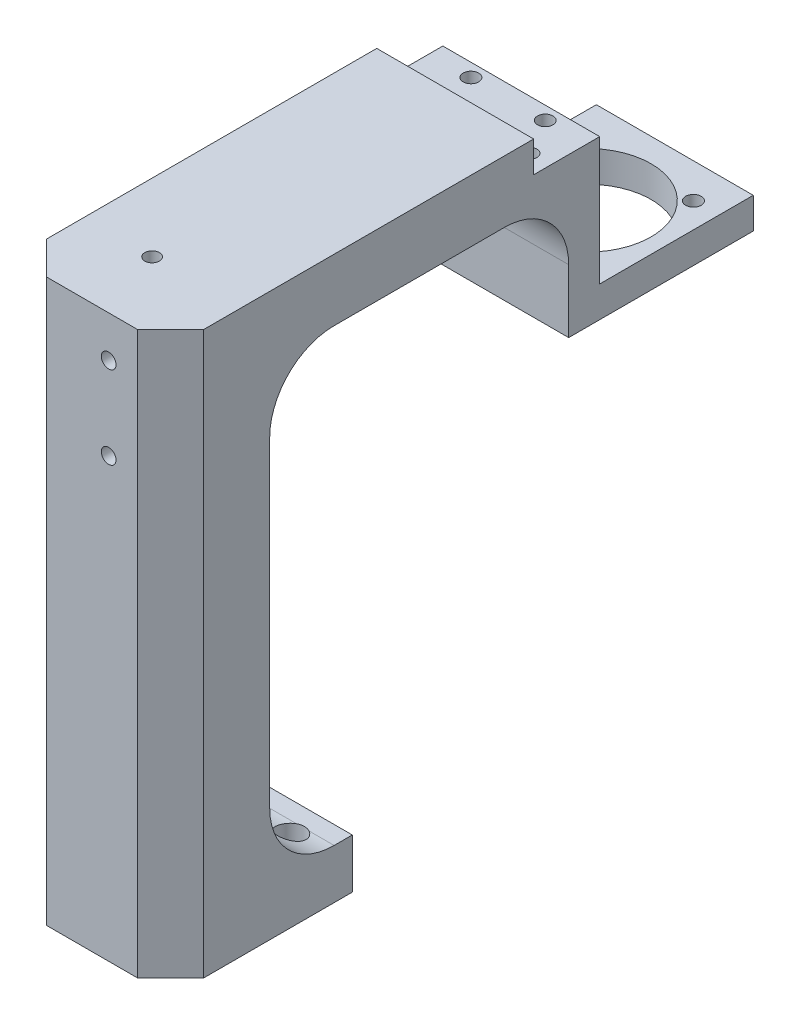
ISO-10303-21;
HEADER;
FILE_DESCRIPTION(('STEP AP214'),'2;1');
FILE_NAME('part.step','',(''),(''),'','','');
FILE_SCHEMA(('AUTOMOTIVE_DESIGN { 1 0 10303 214 1 1 1 1 }'));
ENDSEC;
DATA;
#1=APPLICATION_CONTEXT('core data for automotive mechanical design processes');
#2=APPLICATION_PROTOCOL_DEFINITION('international standard','automotive_design',2000,#1);
#3=PRODUCT_CONTEXT('',#1,'mechanical');
#4=PRODUCT('Part','Part','',(#3));
#5=PRODUCT_RELATED_PRODUCT_CATEGORY('part','',(#4));
#6=PRODUCT_DEFINITION_FORMATION('','',#4);
#7=PRODUCT_DEFINITION_CONTEXT('part definition',#1,'design');
#8=PRODUCT_DEFINITION('design','',#6,#7);
#9=PRODUCT_DEFINITION_SHAPE('','',#8);
#10=(LENGTH_UNIT() NAMED_UNIT(*) SI_UNIT(.MILLI.,.METRE.));
#11=(NAMED_UNIT(*) PLANE_ANGLE_UNIT() SI_UNIT($,.RADIAN.));
#12=(NAMED_UNIT(*) SI_UNIT($,.STERADIAN.) SOLID_ANGLE_UNIT());
#13=UNCERTAINTY_MEASURE_WITH_UNIT(LENGTH_MEASURE(1.E-05),#10,'distance_accuracy_value','');
#14=(GEOMETRIC_REPRESENTATION_CONTEXT(3) GLOBAL_UNCERTAINTY_ASSIGNED_CONTEXT((#13)) GLOBAL_UNIT_ASSIGNED_CONTEXT((#10,
#11,#12)) REPRESENTATION_CONTEXT('',''));
#15=CARTESIAN_POINT('',(0.,0.,0.));
#16=DIRECTION('',(0.,0.,1.));
#17=DIRECTION('',(1.,0.,0.));
#18=AXIS2_PLACEMENT_3D('',#15,#16,#17);
#19=CARTESIAN_POINT('',(-12.065,86.36,-89.5985));
#20=DIRECTION('',(0.,0.,-1.));
#21=DIRECTION('',(0.,1.,0.));
#22=AXIS2_PLACEMENT_3D('',#19,#20,#21);
#23=PLANE('',#22);
#24=DIRECTION('',(-1.,0.,0.));
#25=VECTOR('',#24,1.);
#26=CARTESIAN_POINT('',(-12.065,61.976,-89.5985));
#27=LINE('',#26,#25);
#28=CARTESIAN_POINT('',(12.065,61.976,-89.5985));
#29=VERTEX_POINT('',#28);
#30=CARTESIAN_POINT('',(-12.065,61.976,-89.5985));
#31=VERTEX_POINT('',#30);
#32=EDGE_CURVE('E394',#29,#31,#27,.T.);
#33=ORIENTED_EDGE('',*,*,#32,.F.);
#34=DIRECTION('',(0.,1.,0.));
#35=VECTOR('',#34,1.);
#36=CARTESIAN_POINT('',(12.065,86.36,-89.5985));
#37=LINE('',#36,#35);
#38=CARTESIAN_POINT('',(12.065,57.2135,-89.5985));
#39=VERTEX_POINT('',#38);
#40=EDGE_CURVE('E816',#39,#29,#37,.T.);
#41=ORIENTED_EDGE('',*,*,#40,.F.);
#42=DIRECTION('',(1.,0.,0.));
#43=VECTOR('',#42,1.);
#44=CARTESIAN_POINT('',(-12.065,57.2135,-89.5985));
#45=LINE('',#44,#43);
#46=CARTESIAN_POINT('',(-12.065,57.2135,-89.5985));
#47=VERTEX_POINT('',#46);
#48=EDGE_CURVE('E606',#47,#39,#45,.T.);
#49=ORIENTED_EDGE('',*,*,#48,.F.);
#50=DIRECTION('',(0.,1.,0.));
#51=VECTOR('',#50,1.);
#52=CARTESIAN_POINT('',(-12.065,86.36,-89.5985));
#53=LINE('',#52,#51);
#54=EDGE_CURVE('E582',#47,#31,#53,.T.);
#55=ORIENTED_EDGE('',*,*,#54,.T.);
#56=EDGE_LOOP('',(#33,#41,#49,#55));
#57=FACE_BOUND('',#56,.T.);
#58=ADVANCED_FACE('F49',(#57),#23,.T.);
#59=CARTESIAN_POINT('',(-12.065,0.,-27.94));
#60=DIRECTION('',(0.,0.,-1.));
#61=DIRECTION('',(-1.,0.,0.));
#62=AXIS2_PLACEMENT_3D('',#59,#60,#61);
#63=PLANE('',#62);
#64=DIRECTION('',(1.,0.,0.));
#65=VECTOR('',#64,1.);
#66=CARTESIAN_POINT('',(-12.065,7.62,-27.94));
#67=LINE('',#66,#65);
#68=CARTESIAN_POINT('',(-12.065,7.62,-27.94));
#69=VERTEX_POINT('',#68);
#70=CARTESIAN_POINT('',(12.065,7.62,-27.94));
#71=VERTEX_POINT('',#70);
#72=EDGE_CURVE('E592',#69,#71,#67,.T.);
#73=ORIENTED_EDGE('',*,*,#72,.T.);
#74=DIRECTION('',(0.,1.,0.));
#75=VECTOR('',#74,1.);
#76=CARTESIAN_POINT('',(12.065,0.,-27.94));
#77=LINE('',#76,#75);
#78=CARTESIAN_POINT('',(12.065,0.,-27.94));
#79=VERTEX_POINT('',#78);
#80=EDGE_CURVE('E795',#79,#71,#77,.T.);
#81=ORIENTED_EDGE('',*,*,#80,.F.);
#82=DIRECTION('',(1.,0.,0.));
#83=VECTOR('',#82,1.);
#84=CARTESIAN_POINT('',(-12.065,0.,-27.94));
#85=LINE('',#84,#83);
#86=CARTESIAN_POINT('',(-12.065,0.,-27.94));
#87=VERTEX_POINT('',#86);
#88=EDGE_CURVE('E593',#87,#79,#85,.T.);
#89=ORIENTED_EDGE('',*,*,#88,.F.);
#90=DIRECTION('',(0.,1.,0.));
#91=VECTOR('',#90,1.);
#92=CARTESIAN_POINT('',(-12.065,0.,-27.94));
#93=LINE('',#92,#91);
#94=EDGE_CURVE('E743',#87,#69,#93,.T.);
#95=ORIENTED_EDGE('',*,*,#94,.T.);
#96=EDGE_LOOP('',(#73,#81,#89,#95));
#97=FACE_BOUND('',#96,.T.);
#98=ADVANCED_FACE('F481',(#97),#63,.T.);
#99=CARTESIAN_POINT('',(-12.065,0.,-27.94));
#100=DIRECTION('',(0.,-1.,0.));
#101=DIRECTION('',(0.,0.,-1.));
#102=AXIS2_PLACEMENT_3D('',#99,#100,#101);
#103=PLANE('',#102);
#104=CARTESIAN_POINT('',(7.239,0.,-5.08));
#105=DIRECTION('',(0.,-1.,0.));
#106=DIRECTION('',(0.,0.,-1.));
#107=AXIS2_PLACEMENT_3D('',#104,#105,#106);
#108=CIRCLE('',#107,2.38124999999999);
#109=CARTESIAN_POINT('',(7.239,0.,-7.46124999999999));
#110=VERTEX_POINT('',#109);
#111=EDGE_CURVE('E829',#110,#110,#108,.T.);
#112=ORIENTED_EDGE('',*,*,#111,.F.);
#113=EDGE_LOOP('',(#112));
#114=FACE_BOUND('',#113,.T.);
#115=CARTESIAN_POINT('',(-7.239,0.,-23.368));
#116=DIRECTION('',(0.,-1.,0.));
#117=DIRECTION('',(0.,0.,-1.));
#118=AXIS2_PLACEMENT_3D('',#115,#116,#117);
#119=CIRCLE('',#118,2.38124999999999);
#120=CARTESIAN_POINT('',(-7.239,0.,-25.74925));
#121=VERTEX_POINT('',#120);
#122=EDGE_CURVE('E847',#121,#121,#119,.T.);
#123=ORIENTED_EDGE('',*,*,#122,.F.);
#124=EDGE_LOOP('',(#123));
#125=FACE_BOUND('',#124,.T.);
#126=CARTESIAN_POINT('',(7.239,0.,-23.368));
#127=DIRECTION('',(0.,-1.,0.));
#128=DIRECTION('',(0.,0.,-1.));
#129=AXIS2_PLACEMENT_3D('',#126,#127,#128);
#130=CIRCLE('',#129,2.01929999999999);
#131=CARTESIAN_POINT('',(7.239,0.,-25.3873));
#132=VERTEX_POINT('',#131);
#133=EDGE_CURVE('E854',#132,#132,#130,.T.);
#134=ORIENTED_EDGE('',*,*,#133,.F.);
#135=EDGE_LOOP('',(#134));
#136=FACE_BOUND('',#135,.T.);
#137=CARTESIAN_POINT('',(-7.239,0.,-5.08));
#138=DIRECTION('',(0.,-1.,0.));
#139=DIRECTION('',(0.,0.,-1.));
#140=AXIS2_PLACEMENT_3D('',#137,#138,#139);
#141=CIRCLE('',#140,2.01929999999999);
#142=CARTESIAN_POINT('',(-7.239,0.,-7.09929999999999));
#143=VERTEX_POINT('',#142);
#144=EDGE_CURVE('E861',#143,#143,#141,.T.);
#145=ORIENTED_EDGE('',*,*,#144,.F.);
#146=EDGE_LOOP('',(#145));
#147=FACE_BOUND('',#146,.T.);
#148=DIRECTION('',(0.,0.,-1.));
#149=VECTOR('',#148,1.);
#150=CARTESIAN_POINT('',(12.065,0.,-27.94));
#151=LINE('',#150,#149);
#152=CARTESIAN_POINT('',(12.065,0.,-5.08));
#153=VERTEX_POINT('',#152);
#154=EDGE_CURVE('E748',#153,#79,#151,.T.);
#155=ORIENTED_EDGE('',*,*,#154,.F.);
#156=DIRECTION('',(-0.707106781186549,0.,0.707106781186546));
#157=VECTOR('',#156,1.);
#158=CARTESIAN_POINT('',(11.43,0.,-4.44499999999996));
#159=LINE('',#158,#157);
#160=CARTESIAN_POINT('',(6.98499999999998,0.,0.));
#161=VERTEX_POINT('',#160);
#162=EDGE_CURVE('E641',#153,#161,#159,.T.);
#163=ORIENTED_EDGE('',*,*,#162,.T.);
#164=DIRECTION('',(1.,0.,0.));
#165=VECTOR('',#164,1.);
#166=CARTESIAN_POINT('',(-12.065,0.,0.));
#167=LINE('',#166,#165);
#168=CARTESIAN_POINT('',(-6.98499999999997,0.,0.));
#169=VERTEX_POINT('',#168);
#170=EDGE_CURVE('E598',#169,#161,#167,.T.);
#171=ORIENTED_EDGE('',*,*,#170,.F.);
#172=DIRECTION('',(0.707106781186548,0.,0.707106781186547));
#173=VECTOR('',#172,1.);
#174=CARTESIAN_POINT('',(-23.495,0.,-16.51));
#175=LINE('',#174,#173);
#176=CARTESIAN_POINT('',(-12.065,0.,-5.08000000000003));
#177=VERTEX_POINT('',#176);
#178=EDGE_CURVE('E638',#169,#177,#175,.F.);
#179=ORIENTED_EDGE('',*,*,#178,.T.);
#180=DIRECTION('',(0.,0.,-1.));
#181=VECTOR('',#180,1.);
#182=CARTESIAN_POINT('',(-12.065,0.,-27.94));
#183=LINE('',#182,#181);
#184=EDGE_CURVE('E589',#177,#87,#183,.T.);
#185=ORIENTED_EDGE('',*,*,#184,.T.);
#186=ORIENTED_EDGE('',*,*,#88,.T.);
#187=EDGE_LOOP('',(#155,#163,#171,#179,#185,#186));
#188=FACE_BOUND('',#187,.T.);
#189=ADVANCED_FACE('F487',(#114,#125,#136,#147,#188),#103,.T.);
#190=CARTESIAN_POINT('',(-12.065,0.,0.));
#191=DIRECTION('',(0.,0.,1.));
#192=DIRECTION('',(1.,0.,0.));
#193=AXIS2_PLACEMENT_3D('',#190,#191,#192);
#194=PLANE('',#193);
#195=CARTESIAN_POINT('',(2.54,67.31,0.));
#196=DIRECTION('',(0.,0.,1.));
#197=DIRECTION('',(1.,0.,0.));
#198=AXIS2_PLACEMENT_3D('',#195,#196,#197);
#199=CIRCLE('',#198,1.13029999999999);
#200=CARTESIAN_POINT('',(3.67029999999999,67.31,0.));
#201=VERTEX_POINT('',#200);
#202=EDGE_CURVE('E362',#201,#201,#199,.T.);
#203=ORIENTED_EDGE('',*,*,#202,.F.);
#204=EDGE_LOOP('',(#203));
#205=FACE_BOUND('',#204,.T.);
#206=CARTESIAN_POINT('',(2.54,80.01,0.));
#207=DIRECTION('',(0.,0.,1.));
#208=DIRECTION('',(1.,0.,0.));
#209=AXIS2_PLACEMENT_3D('',#206,#207,#208);
#210=CIRCLE('',#209,1.13029999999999);
#211=CARTESIAN_POINT('',(3.67029999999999,80.01,0.));
#212=VERTEX_POINT('',#211);
#213=EDGE_CURVE('E368',#212,#212,#210,.T.);
#214=ORIENTED_EDGE('',*,*,#213,.F.);
#215=EDGE_LOOP('',(#214));
#216=FACE_BOUND('',#215,.T.);
#217=ORIENTED_EDGE('',*,*,#170,.T.);
#218=DIRECTION('',(0.,1.,0.));
#219=VECTOR('',#218,1.);
#220=CARTESIAN_POINT('',(6.98499999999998,86.36,0.));
#221=LINE('',#220,#219);
#222=CARTESIAN_POINT('',(6.98499999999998,86.36,0.));
#223=VERTEX_POINT('',#222);
#224=EDGE_CURVE('E648',#161,#223,#221,.T.);
#225=ORIENTED_EDGE('',*,*,#224,.T.);
#226=DIRECTION('',(1.,0.,0.));
#227=VECTOR('',#226,1.);
#228=CARTESIAN_POINT('',(-12.065,86.36,0.));
#229=LINE('',#228,#227);
#230=CARTESIAN_POINT('',(-6.98499999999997,86.36,0.));
#231=VERTEX_POINT('',#230);
#232=EDGE_CURVE('E602',#231,#223,#229,.T.);
#233=ORIENTED_EDGE('',*,*,#232,.F.);
#234=DIRECTION('',(0.,-1.,0.));
#235=VECTOR('',#234,1.);
#236=CARTESIAN_POINT('',(-6.98499999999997,0.,0.));
#237=LINE('',#236,#235);
#238=EDGE_CURVE('E644',#231,#169,#237,.T.);
#239=ORIENTED_EDGE('',*,*,#238,.T.);
#240=EDGE_LOOP('',(#217,#225,#233,#239));
#241=FACE_BOUND('',#240,.T.);
#242=ADVANCED_FACE('F707',(#205,#216,#241),#194,.T.);
#243=CARTESIAN_POINT('',(-12.065,86.36,0.));
#244=DIRECTION('',(0.,1.,0.));
#245=DIRECTION('',(0.,0.,1.));
#246=AXIS2_PLACEMENT_3D('',#243,#244,#245);
#247=PLANE('',#246);
#248=CARTESIAN_POINT('',(-1.5748,86.36,-10.795));
#249=DIRECTION('',(0.,1.,0.));
#250=DIRECTION('',(0.,0.,1.));
#251=AXIS2_PLACEMENT_3D('',#248,#249,#250);
#252=CIRCLE('',#251,1.1303);
#253=CARTESIAN_POINT('',(-1.5748,86.36,-9.6647));
#254=VERTEX_POINT('',#253);
#255=EDGE_CURVE('E375',#254,#254,#252,.T.);
#256=ORIENTED_EDGE('',*,*,#255,.F.);
#257=EDGE_LOOP('',(#256));
#258=FACE_BOUND('',#257,.T.);
#259=DIRECTION('',(1.,0.,0.));
#260=VECTOR('',#259,1.);
#261=CARTESIAN_POINT('',(-12.065,86.36,-55.8292));
#262=LINE('',#261,#260);
#263=CARTESIAN_POINT('',(-12.065,86.36,-55.8292));
#264=VERTEX_POINT('',#263);
#265=CARTESIAN_POINT('',(12.065,86.36,-55.8292));
#266=VERTEX_POINT('',#265);
#267=EDGE_CURVE('E841',#264,#266,#262,.T.);
#268=ORIENTED_EDGE('',*,*,#267,.F.);
#269=DIRECTION('',(0.,0.,1.));
#270=VECTOR('',#269,1.);
#271=CARTESIAN_POINT('',(-12.065,86.36,0.));
#272=LINE('',#271,#270);
#273=CARTESIAN_POINT('',(-12.065,86.36,-5.08000000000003));
#274=VERTEX_POINT('',#273);
#275=EDGE_CURVE('E586',#264,#274,#272,.T.);
#276=ORIENTED_EDGE('',*,*,#275,.T.);
#277=DIRECTION('',(-0.707106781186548,0.,-0.707106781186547));
#278=VECTOR('',#277,1.);
#279=CARTESIAN_POINT('',(-9.52499999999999,86.36,-2.54000000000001));
#280=LINE('',#279,#278);
#281=EDGE_CURVE('E651',#274,#231,#280,.F.);
#282=ORIENTED_EDGE('',*,*,#281,.T.);
#283=ORIENTED_EDGE('',*,*,#232,.T.);
#284=DIRECTION('',(0.707106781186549,0.,-0.707106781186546));
#285=VECTOR('',#284,1.);
#286=CARTESIAN_POINT('',(-2.54000000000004,86.36,9.52499999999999));
#287=LINE('',#286,#285);
#288=CARTESIAN_POINT('',(12.065,86.36,-5.08));
#289=VERTEX_POINT('',#288);
#290=EDGE_CURVE('E654',#223,#289,#287,.T.);
#291=ORIENTED_EDGE('',*,*,#290,.T.);
#292=DIRECTION('',(0.,0.,1.));
#293=VECTOR('',#292,1.);
#294=CARTESIAN_POINT('',(12.065,86.36,0.));
#295=LINE('',#294,#293);
#296=EDGE_CURVE('E730',#266,#289,#295,.T.);
#297=ORIENTED_EDGE('',*,*,#296,.F.);
#298=EDGE_LOOP('',(#268,#276,#282,#283,#291,#297));
#299=FACE_BOUND('',#298,.T.);
#300=ADVANCED_FACE('F493',(#258,#299),#247,.T.);
#301=CARTESIAN_POINT('',(-12.065,57.2135,-61.214));
#302=DIRECTION('',(0.,-1.,0.));
#303=DIRECTION('',(0.,0.,-1.));
#304=AXIS2_PLACEMENT_3D('',#301,#302,#303);
#305=PLANE('',#304);
#306=CARTESIAN_POINT('',(-8.19583117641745,57.2135,-68.1328845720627));
#307=DIRECTION('',(0.,-1.,0.));
#308=DIRECTION('',(1.,0.,0.));
#309=AXIS2_PLACEMENT_3D('',#306,#307,#308);
#310=CIRCLE('',#309,2.2);
#311=CARTESIAN_POINT('',(-6.03412014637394,57.2135,-68.5415475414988));
#312=VERTEX_POINT('',#311);
#313=CARTESIAN_POINT('',(-7.75300311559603,57.2135,-70.2878563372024));
#314=VERTEX_POINT('',#313);
#315=EDGE_CURVE('E1049',#312,#314,#310,.T.);
#316=ORIENTED_EDGE('',*,*,#315,.F.);
#317=CARTESIAN_POINT('',(0.,57.2135,-76.2));
#318=DIRECTION('',(0.,-1.,0.));
#319=DIRECTION('',(0.,0.,-1.));
#320=AXIS2_PLACEMENT_3D('',#317,#318,#319);
#321=CIRCLE('',#320,9.74999999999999);
#322=CARTESIAN_POINT('',(5.91214366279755,57.2135,-68.4469968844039));
#323=VERTEX_POINT('',#322);
#324=EDGE_CURVE('E927',#312,#323,#321,.F.);
#325=ORIENTED_EDGE('',*,*,#324,.T.);
#326=CARTESIAN_POINT('',(8.06711542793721,57.2135,-68.0041688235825));
#327=DIRECTION('',(0.,-1.,0.));
#328=DIRECTION('',(0.,0.,-1.));
#329=AXIS2_PLACEMENT_3D('',#326,#327,#328);
#330=CIRCLE('',#329,2.2);
#331=CARTESIAN_POINT('',(7.65845245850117,57.2135,-70.165879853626));
#332=VERTEX_POINT('',#331);
#333=EDGE_CURVE('E935',#332,#323,#330,.T.);
#334=ORIENTED_EDGE('',*,*,#333,.F.);
#335=CARTESIAN_POINT('',(7.75300311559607,57.2135,-82.1121436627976));
#336=VERTEX_POINT('',#335);
#337=EDGE_CURVE('E934',#332,#336,#321,.F.);
#338=ORIENTED_EDGE('',*,*,#337,.T.);
#339=CARTESIAN_POINT('',(8.19583117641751,57.2135,-84.2671154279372));
#340=DIRECTION('',(0.,-1.,0.));
#341=DIRECTION('',(-1.,0.,0.));
#342=AXIS2_PLACEMENT_3D('',#339,#340,#341);
#343=CIRCLE('',#342,2.2);
#344=CARTESIAN_POINT('',(6.034120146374,57.2135,-83.8584524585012));
#345=VERTEX_POINT('',#344);
#346=EDGE_CURVE('E966',#345,#336,#343,.T.);
#347=ORIENTED_EDGE('',*,*,#346,.F.);
#348=CARTESIAN_POINT('',(-5.9121436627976,57.2135,-83.953003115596));
#349=VERTEX_POINT('',#348);
#350=EDGE_CURVE('E941',#345,#349,#321,.F.);
#351=ORIENTED_EDGE('',*,*,#350,.T.);
#352=CARTESIAN_POINT('',(-8.06711542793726,57.2135,-84.3958311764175));
#353=DIRECTION('',(0.,-1.,0.));
#354=DIRECTION('',(0.,0.,1.));
#355=AXIS2_PLACEMENT_3D('',#352,#353,#354);
#356=CIRCLE('',#355,2.2);
#357=CARTESIAN_POINT('',(-7.65845245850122,57.2135,-82.234120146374));
#358=VERTEX_POINT('',#357);
#359=EDGE_CURVE('E1028',#358,#349,#356,.T.);
#360=ORIENTED_EDGE('',*,*,#359,.F.);
#361=EDGE_CURVE('E932',#358,#314,#321,.F.);
#362=ORIENTED_EDGE('',*,*,#361,.T.);
#363=EDGE_LOOP('',(#316,#325,#334,#338,#347,#351,#360,#362));
#364=FACE_BOUND('',#363,.T.);
#365=ORIENTED_EDGE('',*,*,#48,.T.);
#366=DIRECTION('',(0.,0.,-1.));
#367=VECTOR('',#366,1.);
#368=CARTESIAN_POINT('',(12.065,57.2135,-61.214));
#369=LINE('',#368,#367);
#370=CARTESIAN_POINT('',(12.065,57.2135,-61.214));
#371=VERTEX_POINT('',#370);
#372=EDGE_CURVE('E812',#371,#39,#369,.T.);
#373=ORIENTED_EDGE('',*,*,#372,.F.);
#374=DIRECTION('',(1.,0.,0.));
#375=VECTOR('',#374,1.);
#376=CARTESIAN_POINT('',(-12.065,57.2135,-61.214));
#377=LINE('',#376,#375);
#378=CARTESIAN_POINT('',(-12.065,57.2135,-61.214));
#379=VERTEX_POINT('',#378);
#380=EDGE_CURVE('E609',#379,#371,#377,.T.);
#381=ORIENTED_EDGE('',*,*,#380,.F.);
#382=DIRECTION('',(0.,0.,-1.));
#383=VECTOR('',#382,1.);
#384=CARTESIAN_POINT('',(-12.065,57.2135,-61.214));
#385=LINE('',#384,#383);
#386=EDGE_CURVE('E575',#379,#47,#385,.T.);
#387=ORIENTED_EDGE('',*,*,#386,.T.);
#388=EDGE_LOOP('',(#365,#373,#381,#387));
#389=FACE_BOUND('',#388,.T.);
#390=ADVANCED_FACE('F495',(#364,#389),#305,.T.);
#391=CARTESIAN_POINT('',(-12.065,66.929,-61.214));
#392=DIRECTION('',(0.,0.,1.));
#393=DIRECTION('',(1.,0.,0.));
#394=AXIS2_PLACEMENT_3D('',#391,#392,#393);
#395=PLANE('',#394);
#396=ORIENTED_EDGE('',*,*,#380,.T.);
#397=DIRECTION('',(0.,-1.,0.));
#398=VECTOR('',#397,1.);
#399=CARTESIAN_POINT('',(12.065,66.929,-61.214));
#400=LINE('',#399,#398);
#401=CARTESIAN_POINT('',(12.065,66.929,-61.214));
#402=VERTEX_POINT('',#401);
#403=EDGE_CURVE('E808',#402,#371,#400,.T.);
#404=ORIENTED_EDGE('',*,*,#403,.F.);
#405=DIRECTION('',(1.,0.,0.));
#406=VECTOR('',#405,1.);
#407=CARTESIAN_POINT('',(-12.065,66.929,-61.214));
#408=LINE('',#407,#406);
#409=CARTESIAN_POINT('',(-12.065,66.929,-61.214));
#410=VERTEX_POINT('',#409);
#411=EDGE_CURVE('E612',#410,#402,#408,.T.);
#412=ORIENTED_EDGE('',*,*,#411,.F.);
#413=DIRECTION('',(0.,-1.,0.));
#414=VECTOR('',#413,1.);
#415=CARTESIAN_POINT('',(-12.065,66.929,-61.214));
#416=LINE('',#415,#414);
#417=EDGE_CURVE('E570',#410,#379,#416,.T.);
#418=ORIENTED_EDGE('',*,*,#417,.T.);
#419=EDGE_LOOP('',(#396,#404,#412,#418));
#420=FACE_BOUND('',#419,.T.);
#421=ADVANCED_FACE('F498',(#420),#395,.T.);
#422=CARTESIAN_POINT('',(-12.065,66.929,-51.308));
#423=DIRECTION('',(1.,0.,0.));
#424=DIRECTION('',(0.,0.,-1.));
#425=AXIS2_PLACEMENT_3D('',#422,#423,#424);
#426=CYLINDRICAL_SURFACE('',#425,9.906);
#427=CARTESIAN_POINT('',(9.47609075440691,72.7329,-59.3356759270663));
#428=CARTESIAN_POINT('',(9.50964644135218,72.7610936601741,-59.3152978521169));
#429=CARTESIAN_POINT('',(9.54129547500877,72.7905873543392,-59.2937431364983));
#430=CARTESIAN_POINT('',(9.600995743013,72.8514954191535,-59.2486731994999));
#431=CARTESIAN_POINT('',(9.62905485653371,72.8829053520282,-59.2251624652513));
#432=CARTESIAN_POINT('',(9.68180029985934,72.9469305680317,-59.1766060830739));
#433=CARTESIAN_POINT('',(9.70650345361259,72.9795387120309,-59.1515690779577));
#434=CARTESIAN_POINT('',(9.75293266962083,73.0457543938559,-59.1000416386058));
#435=CARTESIAN_POINT('',(9.77465634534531,73.0793627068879,-59.0735500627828));
#436=CARTESIAN_POINT('',(9.82279326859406,73.1598501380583,-59.009226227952));
#437=CARTESIAN_POINT('',(9.84795897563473,73.2070295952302,-58.9708309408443));
#438=CARTESIAN_POINT('',(9.89318398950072,73.3020984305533,-58.8919491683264));
#439=CARTESIAN_POINT('',(9.91323986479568,73.3499882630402,-58.8514612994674));
#440=CARTESIAN_POINT('',(9.96601455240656,73.4944487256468,-58.7268848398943));
#441=CARTESIAN_POINT('',(9.99114315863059,73.5914711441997,-58.6399526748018));
#442=CARTESIAN_POINT('',(10.0203897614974,73.7845288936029,-58.4597975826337));
#443=CARTESIAN_POINT('',(10.0243052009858,73.8805460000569,-58.3665225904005));
#444=CARTESIAN_POINT('',(10.0079086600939,74.0675226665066,-58.1773383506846));
#445=CARTESIAN_POINT('',(9.98769639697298,74.1585014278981,-58.0814415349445));
#446=CARTESIAN_POINT('',(9.93223686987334,74.2992419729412,-57.9272824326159));
#447=CARTESIAN_POINT('',(9.90545974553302,74.3516754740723,-57.8683809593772));
#448=CARTESIAN_POINT('',(9.84000541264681,74.4518893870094,-57.7532114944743));
#449=CARTESIAN_POINT('',(9.80134077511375,74.4996746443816,-57.6969407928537));
#450=CARTESIAN_POINT('',(9.72011332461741,74.5803321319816,-57.5999907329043));
#451=CARTESIAN_POINT('',(9.67973968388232,74.6143032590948,-57.5583971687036));
#452=CARTESIAN_POINT('',(9.59077724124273,74.6770895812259,-57.4803935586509));
#453=CARTESIAN_POINT('',(9.54219761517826,74.7059104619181,-57.4439778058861));
#454=CARTESIAN_POINT('',(9.44565158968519,74.7531935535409,-57.3835305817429));
#455=CARTESIAN_POINT('',(9.39879233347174,74.7725721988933,-57.3584520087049));
#456=CARTESIAN_POINT('',(9.30043336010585,74.8061446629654,-57.3146788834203));
#457=CARTESIAN_POINT('',(9.24893536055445,74.8203403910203,-57.2959819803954));
#458=CARTESIAN_POINT('',(9.14230891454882,74.8429845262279,-57.2660235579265));
#459=CARTESIAN_POINT('',(9.08716412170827,74.8514048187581,-57.2547984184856));
#460=CARTESIAN_POINT('',(8.97522612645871,74.8619618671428,-57.240708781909));
#461=CARTESIAN_POINT('',(8.91843350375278,74.8641008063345,-57.2378413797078));
#462=CARTESIAN_POINT('',(8.8101267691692,74.8620837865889,-57.2405387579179));
#463=CARTESIAN_POINT('',(8.75858277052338,74.8584586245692,-57.2453925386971));
#464=CARTESIAN_POINT('',(8.65725662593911,74.8460474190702,-57.2619316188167));
#465=CARTESIAN_POINT('',(8.60747433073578,74.8372618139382,-57.2736163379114));
#466=CARTESIAN_POINT('',(8.51081397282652,74.8148589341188,-57.3031985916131));
#467=CARTESIAN_POINT('',(8.46394369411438,74.801229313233,-57.3211119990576));
#468=CARTESIAN_POINT('',(8.3741831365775,74.7696365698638,-57.3622485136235));
#469=CARTESIAN_POINT('',(8.33129387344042,74.751672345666,-57.3854729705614));
#470=CARTESIAN_POINT('',(8.24597723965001,74.7099415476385,-57.4388269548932));
#471=CARTESIAN_POINT('',(8.20403769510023,74.6857713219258,-57.4694178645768));
#472=CARTESIAN_POINT('',(8.12609041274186,74.633570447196,-57.5345704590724));
#473=CARTESIAN_POINT('',(8.09008646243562,74.6055373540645,-57.5691346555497));
#474=CARTESIAN_POINT('',(8.00869346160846,74.5324637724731,-57.6578668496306));
#475=CARTESIAN_POINT('',(7.96673185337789,74.4855787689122,-57.7136735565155));
#476=CARTESIAN_POINT('',(7.89507318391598,74.3866849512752,-57.8285489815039));
#477=CARTESIAN_POINT('',(7.86540262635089,74.3346653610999,-57.8876244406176));
#478=CARTESIAN_POINT('',(7.80971290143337,74.2096624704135,-58.0260353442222));
#479=CARTESIAN_POINT('',(7.78789682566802,74.135295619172,-58.1058074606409));
#480=CARTESIAN_POINT('',(7.76172276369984,73.9825331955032,-58.2641965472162));
#481=CARTESIAN_POINT('',(7.75737605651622,73.9041350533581,-58.3428127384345));
#482=CARTESIAN_POINT('',(7.76437189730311,73.7434567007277,-58.4986049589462));
#483=CARTESIAN_POINT('',(7.77604564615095,73.6611295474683,-58.5757161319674));
#484=CARTESIAN_POINT('',(7.81452634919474,73.4957777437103,-58.7254603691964));
#485=CARTESIAN_POINT('',(7.84135060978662,73.4127524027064,-58.798088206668));
#486=CARTESIAN_POINT('',(7.90786685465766,73.2529376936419,-58.9334156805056));
#487=CARTESIAN_POINT('',(7.94669750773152,73.1760713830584,-58.996448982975));
#488=CARTESIAN_POINT('',(8.03824244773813,73.0259443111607,-59.1160222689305));
#489=CARTESIAN_POINT('',(8.09089637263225,72.952669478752,-59.1725889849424));
#490=CARTESIAN_POINT('',(8.1744546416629,72.8568038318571,-59.2446922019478));
#491=CARTESIAN_POINT('',(8.19856408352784,72.8309922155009,-59.2638967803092));
#492=CARTESIAN_POINT('',(8.24930237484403,72.7807799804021,-59.3009020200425));
#493=CARTESIAN_POINT('',(8.27593542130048,72.756381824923,-59.3187002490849));
#494=CARTESIAN_POINT('',(8.30390924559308,72.7329,-59.3356759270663));
#495=B_SPLINE_CURVE_WITH_KNOTS('',3,(#427,#428,#429,#430,#431,#432,#433,#434,#435,#436,#437,
#438,#439,#440,#441,#442,#443,#444,#445,#446,#447,#448,#449,#450,#451,#452,#453,#454,#455,#456,
#457,#458,#459,#460,#461,#462,#463,#464,#465,#466,#467,#468,#469,#470,#471,#472,#473,#474,#475,
#476,#477,#478,#479,#480,#481,#482,#483,#484,#485,#486,#487,#488,#489,#490,#491,#492,#493,#494),
.UNSPECIFIED.,.F.,.F.,(4,2,2,2,2,2,2,2,2,2,2,2,2,2,2,2,2,2,2,2,2,2,2,2,2,2,2,2,2,2,2,2,2,4),(0.,
0.144831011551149,0.289338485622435,0.433092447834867,0.57696089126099,0.774170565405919,
0.971512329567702,1.36760673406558,1.76747672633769,2.16569980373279,2.41472556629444,
2.66348888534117,2.86428576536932,3.06485958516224,3.23386149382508,3.40280108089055,
3.57255733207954,3.74225457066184,3.89720733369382,4.05214693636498,4.20748430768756,
4.36286120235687,4.53399339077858,4.70523435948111,4.95614897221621,5.20760186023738,
5.53947947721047,5.87157133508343,6.21063313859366,6.55008303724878,6.86932008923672,
7.18718566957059,7.30768673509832,7.42839184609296),.UNSPECIFIED.);
#496=CARTESIAN_POINT('',(9.47609075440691,72.7329,-59.3356759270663));
#497=VERTEX_POINT('',#496);
#498=CARTESIAN_POINT('',(8.30390924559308,72.7329,-59.3356759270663));
#499=VERTEX_POINT('',#498);
#500=EDGE_CURVE('E12',#497,#499,#495,.T.);
#501=ORIENTED_EDGE('',*,*,#500,.F.);
#502=CARTESIAN_POINT('',(6.53672628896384,73.4846663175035,-58.7344443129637));
#503=CARTESIAN_POINT('',(6.58715380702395,73.45697971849,-58.7588848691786));
#504=CARTESIAN_POINT('',(6.63787538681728,73.4294587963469,-58.7829029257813));
#505=CARTESIAN_POINT('',(6.73994773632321,73.3748245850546,-58.830066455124));
#506=CARTESIAN_POINT('',(6.7912985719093,73.3477113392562,-58.8532118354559));
#507=CARTESIAN_POINT('',(6.9466128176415,73.2669647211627,-58.9214095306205));
#508=CARTESIAN_POINT('',(7.0515726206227,73.2140712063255,-58.9650942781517));
#509=CARTESIAN_POINT('',(7.26362382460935,73.1117029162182,-59.0479818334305));
#510=CARTESIAN_POINT('',(7.3706888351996,73.0622024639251,-59.0872202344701));
#511=CARTESIAN_POINT('',(7.58836181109,72.967730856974,-59.1607784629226));
#512=CARTESIAN_POINT('',(7.69896526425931,72.9227542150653,-59.1951042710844));
#513=CARTESIAN_POINT('',(7.85078485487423,72.8670191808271,-59.2370031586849));
#514=CARTESIAN_POINT('',(7.89007685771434,72.8531181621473,-59.2473916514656));
#515=CARTESIAN_POINT('',(7.9693601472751,72.8262826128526,-59.2673450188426));
#516=CARTESIAN_POINT('',(8.00935340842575,72.8133516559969,-59.2769068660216));
#517=CARTESIAN_POINT('',(8.11571338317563,72.7807852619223,-59.3008765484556));
#518=CARTESIAN_POINT('',(8.18258118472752,72.7621541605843,-59.3144702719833));
#519=CARTESIAN_POINT('',(8.31791544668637,72.7289918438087,-59.3385262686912));
#520=CARTESIAN_POINT('',(8.38638217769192,72.7144613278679,-59.3489880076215));
#521=CARTESIAN_POINT('',(8.52427495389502,72.6905563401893,-59.3661339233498));
#522=CARTESIAN_POINT('',(8.59369272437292,72.6811513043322,-59.3728404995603));
#523=CARTESIAN_POINT('',(8.73334271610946,72.6681807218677,-59.3820762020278));
#524=CARTESIAN_POINT('',(8.80357463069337,72.6646130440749,-59.3846068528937));
#525=CARTESIAN_POINT('',(8.94645451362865,72.6636573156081,-59.3852856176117));
#526=CARTESIAN_POINT('',(9.01910479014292,72.6664797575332,-59.3832844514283));
#527=CARTESIAN_POINT('',(9.16361794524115,72.6784384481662,-59.3747740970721));
#528=CARTESIAN_POINT('',(9.23548053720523,72.6875769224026,-59.3682633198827));
#529=CARTESIAN_POINT('',(9.378868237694,72.7114839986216,-59.3511293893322));
#530=CARTESIAN_POINT('',(9.45037166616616,72.72633595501,-59.3404453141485));
#531=CARTESIAN_POINT('',(9.59165391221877,72.7605520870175,-59.3156390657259));
#532=CARTESIAN_POINT('',(9.66143253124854,72.7799167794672,-59.3015164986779));
#533=CARTESIAN_POINT('',(9.84531223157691,72.8362045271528,-59.2600853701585));
#534=CARTESIAN_POINT('',(9.95789086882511,72.8762167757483,-59.2302695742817));
#535=CARTESIAN_POINT('',(10.179047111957,72.9623386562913,-59.1648823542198));
#536=CARTESIAN_POINT('',(10.2876184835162,73.008457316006,-59.1293023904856));
#537=CARTESIAN_POINT('',(10.4967171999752,73.1024793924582,-59.0552843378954));
#538=CARTESIAN_POINT('',(10.5973886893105,73.150216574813,-59.0170392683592));
#539=CARTESIAN_POINT('',(10.7462461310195,73.2235133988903,-58.9571131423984));
#540=CARTESIAN_POINT('',(10.795416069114,73.2481793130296,-58.9367522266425));
#541=CARTESIAN_POINT('',(10.8931444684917,73.2980035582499,-58.8952051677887));
#542=CARTESIAN_POINT('',(10.9417030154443,73.3231618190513,-58.8740191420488));
#543=CARTESIAN_POINT('',(10.989981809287,73.3485210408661,-58.8524407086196));
#544=B_SPLINE_CURVE_WITH_KNOTS('',3,(#502,#503,#504,#505,#506,#507,#508,#509,#510,#511,#512,
#513,#514,#515,#516,#517,#518,#519,#520,#521,#522,#523,#524,#525,#526,#527,#528,#529,#530,#531,
#532,#533,#534,#535,#536,#537,#538,#539,#540,#541,#542,#543),.UNSPECIFIED.,.F.,.F.,(4,2,2,2,2,2,
2,2,2,2,2,2,2,2,2,2,2,2,2,2,4),(0.,0.187507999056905,0.375035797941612,0.75107948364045,
1.12386099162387,1.49618473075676,1.62502569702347,1.75432012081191,1.96634568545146,
2.17840739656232,2.38919031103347,2.59989625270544,2.81764348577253,3.03546748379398,
3.25659784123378,3.47775353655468,3.84660936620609,4.21601673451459,4.56927032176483,
4.74523325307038,4.92117124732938),.UNSPECIFIED.);
#545=EDGE_CURVE('E59',#499,#497,#544,.T.);
#546=ORIENTED_EDGE('',*,*,#545,.F.);
#547=EDGE_LOOP('',(#501,#546));
#548=FACE_BOUND('',#547,.T.);
#549=CARTESIAN_POINT('',(-8.30390924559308,72.7329,-59.3356759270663));
#550=CARTESIAN_POINT('',(-8.27035355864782,72.7610936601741,-59.3152978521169));
#551=CARTESIAN_POINT('',(-8.23870452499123,72.7905873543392,-59.2937431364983));
#552=CARTESIAN_POINT('',(-8.179004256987,72.8514954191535,-59.2486731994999));
#553=CARTESIAN_POINT('',(-8.15094514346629,72.8829053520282,-59.2251624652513));
#554=CARTESIAN_POINT('',(-8.09819970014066,72.9469305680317,-59.1766060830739));
#555=CARTESIAN_POINT('',(-8.07349654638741,72.9795387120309,-59.1515690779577));
#556=CARTESIAN_POINT('',(-8.02706733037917,73.0457543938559,-59.1000416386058));
#557=CARTESIAN_POINT('',(-8.00534365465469,73.0793627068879,-59.0735500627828));
#558=CARTESIAN_POINT('',(-7.95720673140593,73.1598501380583,-59.009226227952));
#559=CARTESIAN_POINT('',(-7.93204102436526,73.2070295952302,-58.9708309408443));
#560=CARTESIAN_POINT('',(-7.88681601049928,73.3020984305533,-58.8919491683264));
#561=CARTESIAN_POINT('',(-7.86676013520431,73.3499882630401,-58.8514612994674));
#562=CARTESIAN_POINT('',(-7.81398544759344,73.4944487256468,-58.7268848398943));
#563=CARTESIAN_POINT('',(-7.78885684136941,73.5914711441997,-58.6399526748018));
#564=CARTESIAN_POINT('',(-7.75961023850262,73.7845288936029,-58.4597975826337));
#565=CARTESIAN_POINT('',(-7.75569479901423,73.8805460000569,-58.3665225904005));
#566=CARTESIAN_POINT('',(-7.77209133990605,74.0675226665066,-58.1773383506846));
#567=CARTESIAN_POINT('',(-7.79230360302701,74.1585014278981,-58.0814415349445));
#568=CARTESIAN_POINT('',(-7.84776313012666,74.2992419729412,-57.9272824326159));
#569=CARTESIAN_POINT('',(-7.87454025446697,74.3516754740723,-57.8683809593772));
#570=CARTESIAN_POINT('',(-7.93999458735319,74.4518893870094,-57.7532114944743));
#571=CARTESIAN_POINT('',(-7.97865922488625,74.4996746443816,-57.6969407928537));
#572=CARTESIAN_POINT('',(-8.05988667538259,74.5803321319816,-57.5999907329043));
#573=CARTESIAN_POINT('',(-8.10026031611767,74.6143032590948,-57.5583971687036));
#574=CARTESIAN_POINT('',(-8.18922275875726,74.6770895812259,-57.4803935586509));
#575=CARTESIAN_POINT('',(-8.23780238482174,74.7059104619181,-57.4439778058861));
#576=CARTESIAN_POINT('',(-8.3343484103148,74.7531935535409,-57.3835305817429));
#577=CARTESIAN_POINT('',(-8.38120766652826,74.7725721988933,-57.3584520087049));
#578=CARTESIAN_POINT('',(-8.47956663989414,74.8061446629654,-57.3146788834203));
#579=CARTESIAN_POINT('',(-8.53106463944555,74.8203403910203,-57.2959819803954));
#580=CARTESIAN_POINT('',(-8.63769108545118,74.8429845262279,-57.2660235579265));
#581=CARTESIAN_POINT('',(-8.69283587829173,74.8514048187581,-57.2547984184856));
#582=CARTESIAN_POINT('',(-8.80477387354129,74.8619618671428,-57.240708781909));
#583=CARTESIAN_POINT('',(-8.86156649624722,74.8641008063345,-57.2378413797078));
#584=CARTESIAN_POINT('',(-8.9698732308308,74.8620837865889,-57.2405387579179));
#585=CARTESIAN_POINT('',(-9.02141722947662,74.8584586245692,-57.2453925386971));
#586=CARTESIAN_POINT('',(-9.12274337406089,74.8460474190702,-57.2619316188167));
#587=CARTESIAN_POINT('',(-9.17252566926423,74.8372618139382,-57.2736163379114));
#588=CARTESIAN_POINT('',(-9.26918602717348,74.8148589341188,-57.3031985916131));
#589=CARTESIAN_POINT('',(-9.31605630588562,74.801229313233,-57.3211119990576));
#590=CARTESIAN_POINT('',(-9.4058168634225,74.7696365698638,-57.3622485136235));
#591=CARTESIAN_POINT('',(-9.44870612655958,74.751672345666,-57.3854729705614));
#592=CARTESIAN_POINT('',(-9.53402276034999,74.7099415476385,-57.4388269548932));
#593=CARTESIAN_POINT('',(-9.57596230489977,74.6857713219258,-57.4694178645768));
#594=CARTESIAN_POINT('',(-9.65390958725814,74.633570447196,-57.5345704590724));
#595=CARTESIAN_POINT('',(-9.68991353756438,74.6055373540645,-57.5691346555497));
#596=CARTESIAN_POINT('',(-9.77130653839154,74.5324637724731,-57.6578668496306));
#597=CARTESIAN_POINT('',(-9.81326814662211,74.4855787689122,-57.7136735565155));
#598=CARTESIAN_POINT('',(-9.88492681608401,74.3866849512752,-57.8285489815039));
#599=CARTESIAN_POINT('',(-9.91459737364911,74.3346653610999,-57.8876244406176));
#600=CARTESIAN_POINT('',(-9.97028709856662,74.2096624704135,-58.0260353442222));
#601=CARTESIAN_POINT('',(-9.99210317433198,74.135295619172,-58.1058074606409));
#602=CARTESIAN_POINT('',(-10.0182772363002,73.9825331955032,-58.2641965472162));
#603=CARTESIAN_POINT('',(-10.0226239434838,73.9041350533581,-58.3428127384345));
#604=CARTESIAN_POINT('',(-10.0156281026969,73.7434567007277,-58.4986049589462));
#605=CARTESIAN_POINT('',(-10.003954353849,73.6611295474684,-58.5757161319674));
#606=CARTESIAN_POINT('',(-9.96547365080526,73.4957777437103,-58.7254603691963));
#607=CARTESIAN_POINT('',(-9.93864939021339,73.4127524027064,-58.798088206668));
#608=CARTESIAN_POINT('',(-9.87213314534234,73.2529376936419,-58.9334156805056));
#609=CARTESIAN_POINT('',(-9.83330249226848,73.1760713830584,-58.996448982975));
#610=CARTESIAN_POINT('',(-9.74175755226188,73.0259443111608,-59.1160222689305));
#611=CARTESIAN_POINT('',(-9.68910362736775,72.952669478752,-59.1725889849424));
#612=CARTESIAN_POINT('',(-9.6055453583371,72.8568038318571,-59.2446922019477));
#613=CARTESIAN_POINT('',(-9.58143591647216,72.8309922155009,-59.2638967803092));
#614=CARTESIAN_POINT('',(-9.53069762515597,72.7807799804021,-59.3009020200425));
#615=CARTESIAN_POINT('',(-9.50406457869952,72.756381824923,-59.3187002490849));
#616=CARTESIAN_POINT('',(-9.47609075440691,72.7329,-59.3356759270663));
#617=B_SPLINE_CURVE_WITH_KNOTS('',3,(#549,#550,#551,#552,#553,#554,#555,#556,#557,#558,#559,
#560,#561,#562,#563,#564,#565,#566,#567,#568,#569,#570,#571,#572,#573,#574,#575,#576,#577,#578,
#579,#580,#581,#582,#583,#584,#585,#586,#587,#588,#589,#590,#591,#592,#593,#594,#595,#596,#597,
#598,#599,#600,#601,#602,#603,#604,#605,#606,#607,#608,#609,#610,#611,#612,#613,#614,#615,#616),
.UNSPECIFIED.,.F.,.F.,(4,2,2,2,2,2,2,2,2,2,2,2,2,2,2,2,2,2,2,2,2,2,2,2,2,2,2,2,2,2,2,2,2,4),(0.,
0.144831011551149,0.289338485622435,0.433092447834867,0.57696089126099,0.774170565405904,
0.971512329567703,1.36760673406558,1.76747672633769,2.16569980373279,2.41472556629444,
2.66348888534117,2.86428576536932,3.06485958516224,3.23386149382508,3.40280108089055,
3.57255733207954,3.74225457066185,3.89720733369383,4.05214693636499,4.20748430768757,
4.36286120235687,4.53399339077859,4.70523435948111,4.95614897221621,5.20760186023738,
5.53947947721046,5.87157133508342,6.21063313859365,6.55008303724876,6.8693200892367,
7.18718566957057,7.30768673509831,7.42839184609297),.UNSPECIFIED.);
#618=CARTESIAN_POINT('',(-8.30390924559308,72.7329,-59.3356759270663));
#619=VERTEX_POINT('',#618);
#620=CARTESIAN_POINT('',(-9.47609075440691,72.7329,-59.3356759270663));
#621=VERTEX_POINT('',#620);
#622=EDGE_CURVE('E520',#619,#621,#617,.T.);
#623=ORIENTED_EDGE('',*,*,#622,.F.);
#624=CARTESIAN_POINT('',(-11.2432737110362,73.4846663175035,-58.7344443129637));
#625=CARTESIAN_POINT('',(-11.192846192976,73.45697971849,-58.7588848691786));
#626=CARTESIAN_POINT('',(-11.1421246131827,73.4294587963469,-58.7829029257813));
#627=CARTESIAN_POINT('',(-11.0400522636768,73.3748245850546,-58.830066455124));
#628=CARTESIAN_POINT('',(-10.9887014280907,73.3477113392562,-58.8532118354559));
#629=CARTESIAN_POINT('',(-10.8333871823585,73.2669647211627,-58.9214095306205));
#630=CARTESIAN_POINT('',(-10.7284273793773,73.2140712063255,-58.9650942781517));
#631=CARTESIAN_POINT('',(-10.5163761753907,73.1117029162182,-59.0479818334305));
#632=CARTESIAN_POINT('',(-10.4093111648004,73.0622024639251,-59.0872202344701));
#633=CARTESIAN_POINT('',(-10.19163818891,72.967730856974,-59.1607784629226));
#634=CARTESIAN_POINT('',(-10.0810347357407,72.9227542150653,-59.1951042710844));
#635=CARTESIAN_POINT('',(-9.92921514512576,72.8670191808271,-59.2370031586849));
#636=CARTESIAN_POINT('',(-9.88992314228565,72.8531181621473,-59.2473916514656));
#637=CARTESIAN_POINT('',(-9.81063985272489,72.8262826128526,-59.2673450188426));
#638=CARTESIAN_POINT('',(-9.77064659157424,72.8133516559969,-59.2769068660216));
#639=CARTESIAN_POINT('',(-9.66428661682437,72.7807852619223,-59.3008765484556));
#640=CARTESIAN_POINT('',(-9.59741881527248,72.7621541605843,-59.3144702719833));
#641=CARTESIAN_POINT('',(-9.46208455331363,72.7289918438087,-59.3385262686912));
#642=CARTESIAN_POINT('',(-9.39361782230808,72.7144613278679,-59.3489880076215));
#643=CARTESIAN_POINT('',(-9.25572504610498,72.6905563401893,-59.3661339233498));
#644=CARTESIAN_POINT('',(-9.18630727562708,72.6811513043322,-59.3728404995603));
#645=CARTESIAN_POINT('',(-9.04665728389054,72.6681807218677,-59.3820762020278));
#646=CARTESIAN_POINT('',(-8.97642536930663,72.6646130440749,-59.3846068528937));
#647=CARTESIAN_POINT('',(-8.83354548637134,72.6636573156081,-59.3852856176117));
#648=CARTESIAN_POINT('',(-8.76089520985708,72.6664797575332,-59.3832844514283));
#649=CARTESIAN_POINT('',(-8.61638205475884,72.6784384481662,-59.3747740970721));
#650=CARTESIAN_POINT('',(-8.54451946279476,72.6875769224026,-59.3682633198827));
#651=CARTESIAN_POINT('',(-8.401131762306,72.7114839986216,-59.3511293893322));
#652=CARTESIAN_POINT('',(-8.32962833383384,72.72633595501,-59.3404453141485));
#653=CARTESIAN_POINT('',(-8.18834608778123,72.7605520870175,-59.3156390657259));
#654=CARTESIAN_POINT('',(-8.11856746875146,72.7799167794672,-59.3015164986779));
#655=CARTESIAN_POINT('',(-7.93468776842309,72.8362045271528,-59.2600853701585));
#656=CARTESIAN_POINT('',(-7.82210913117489,72.8762167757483,-59.2302695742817));
#657=CARTESIAN_POINT('',(-7.60095288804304,72.9623386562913,-59.1648823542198));
#658=CARTESIAN_POINT('',(-7.49238151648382,73.008457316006,-59.1293023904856));
#659=CARTESIAN_POINT('',(-7.28328280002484,73.1024793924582,-59.0552843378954));
#660=CARTESIAN_POINT('',(-7.18261131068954,73.150216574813,-59.0170392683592));
#661=CARTESIAN_POINT('',(-7.03375386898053,73.2235133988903,-58.9571131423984));
#662=CARTESIAN_POINT('',(-6.984583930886,73.2481793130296,-58.9367522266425));
#663=CARTESIAN_POINT('',(-6.88685553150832,73.2980035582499,-58.8952051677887));
#664=CARTESIAN_POINT('',(-6.83829698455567,73.3231618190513,-58.8740191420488));
#665=CARTESIAN_POINT('',(-6.79001819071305,73.3485210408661,-58.8524407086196));
#666=B_SPLINE_CURVE_WITH_KNOTS('',3,(#624,#625,#626,#627,#628,#629,#630,#631,#632,#633,#634,
#635,#636,#637,#638,#639,#640,#641,#642,#643,#644,#645,#646,#647,#648,#649,#650,#651,#652,#653,
#654,#655,#656,#657,#658,#659,#660,#661,#662,#663,#664,#665),.UNSPECIFIED.,.F.,.F.,(4,2,2,2,2,2,
2,2,2,2,2,2,2,2,2,2,2,2,2,2,4),(0.,0.187507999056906,0.37503579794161,0.75107948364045,
1.12386099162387,1.49618473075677,1.62502569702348,1.75432012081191,1.96634568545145,
2.17840739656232,2.38919031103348,2.59989625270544,2.81764348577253,3.03546748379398,
3.25659784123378,3.47775353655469,3.84660936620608,4.21601673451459,4.56927032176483,
4.74523325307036,4.92117124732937),.UNSPECIFIED.);
#667=EDGE_CURVE('E513',#621,#619,#666,.T.);
#668=ORIENTED_EDGE('',*,*,#667,.F.);
#669=EDGE_LOOP('',(#623,#668));
#670=FACE_BOUND('',#669,.T.);
#671=ORIENTED_EDGE('',*,*,#411,.T.);
#672=CARTESIAN_POINT('',(12.065,66.929,-51.308));
#673=DIRECTION('',(-1.,0.,0.));
#674=DIRECTION('',(0.,0.,-1.));
#675=AXIS2_PLACEMENT_3D('',#672,#673,#674);
#676=CIRCLE('',#675,9.906);
#677=CARTESIAN_POINT('',(12.065,76.835,-51.308));
#678=VERTEX_POINT('',#677);
#679=EDGE_CURVE('E804',#678,#402,#676,.T.);
#680=ORIENTED_EDGE('',*,*,#679,.F.);
#681=DIRECTION('',(1.,0.,0.));
#682=VECTOR('',#681,1.);
#683=CARTESIAN_POINT('',(-12.065,76.835,-51.308));
#684=LINE('',#683,#682);
#685=CARTESIAN_POINT('',(-12.065,76.835,-51.308));
#686=VERTEX_POINT('',#685);
#687=EDGE_CURVE('E615',#686,#678,#684,.T.);
#688=ORIENTED_EDGE('',*,*,#687,.F.);
#689=CARTESIAN_POINT('',(-12.065,66.929,-51.308));
#690=DIRECTION('',(-1.,0.,0.));
#691=DIRECTION('',(0.,0.,-1.));
#692=AXIS2_PLACEMENT_3D('',#689,#690,#691);
#693=CIRCLE('',#692,9.906);
#694=EDGE_CURVE('E566',#686,#410,#693,.T.);
#695=ORIENTED_EDGE('',*,*,#694,.T.);
#696=EDGE_LOOP('',(#671,#680,#688,#695));
#697=FACE_BOUND('',#696,.T.);
#698=ADVANCED_FACE('F502',(#548,#670,#697),#426,.F.);
#699=CARTESIAN_POINT('',(-12.065,76.835,-25.146));
#700=DIRECTION('',(0.,-1.,0.));
#701=DIRECTION('',(0.,0.,-1.));
#702=AXIS2_PLACEMENT_3D('',#699,#700,#701);
#703=PLANE('',#702);
#704=ORIENTED_EDGE('',*,*,#687,.T.);
#705=DIRECTION('',(0.,0.,-1.));
#706=VECTOR('',#705,1.);
#707=CARTESIAN_POINT('',(12.065,76.835,-25.146));
#708=LINE('',#707,#706);
#709=CARTESIAN_POINT('',(12.065,76.835,-25.146));
#710=VERTEX_POINT('',#709);
#711=EDGE_CURVE('E800',#710,#678,#708,.T.);
#712=ORIENTED_EDGE('',*,*,#711,.F.);
#713=DIRECTION('',(1.,0.,0.));
#714=VECTOR('',#713,1.);
#715=CARTESIAN_POINT('',(-12.065,76.835,-25.146));
#716=LINE('',#715,#714);
#717=CARTESIAN_POINT('',(-12.065,76.835,-25.146));
#718=VERTEX_POINT('',#717);
#719=EDGE_CURVE('E618',#718,#710,#716,.T.);
#720=ORIENTED_EDGE('',*,*,#719,.F.);
#721=DIRECTION('',(0.,0.,-1.));
#722=VECTOR('',#721,1.);
#723=CARTESIAN_POINT('',(-12.065,76.835,-25.146));
#724=LINE('',#723,#722);
#725=EDGE_CURVE('E563',#718,#686,#724,.T.);
#726=ORIENTED_EDGE('',*,*,#725,.T.);
#727=EDGE_LOOP('',(#704,#712,#720,#726));
#728=FACE_BOUND('',#727,.T.);
#729=ADVANCED_FACE('F507',(#728),#703,.T.);
#730=CARTESIAN_POINT('',(-12.065,66.929,-25.146));
#731=DIRECTION('',(1.,0.,0.));
#732=DIRECTION('',(0.,0.,-1.));
#733=AXIS2_PLACEMENT_3D('',#730,#731,#732);
#734=CYLINDRICAL_SURFACE('',#733,9.906);
#735=ORIENTED_EDGE('',*,*,#719,.T.);
#736=CARTESIAN_POINT('',(12.065,66.929,-25.146));
#737=DIRECTION('',(-1.,0.,0.));
#738=DIRECTION('',(0.,0.,1.));
#739=AXIS2_PLACEMENT_3D('',#736,#737,#738);
#740=CIRCLE('',#739,9.906);
#741=CARTESIAN_POINT('',(12.065,66.929,-15.24));
#742=VERTEX_POINT('',#741);
#743=EDGE_CURVE('E793',#742,#710,#740,.T.);
#744=ORIENTED_EDGE('',*,*,#743,.F.);
#745=DIRECTION('',(1.,0.,0.));
#746=VECTOR('',#745,1.);
#747=CARTESIAN_POINT('',(-12.065,66.929,-15.24));
#748=LINE('',#747,#746);
#749=CARTESIAN_POINT('',(-12.065,66.929,-15.24));
#750=VERTEX_POINT('',#749);
#751=EDGE_CURVE('E621',#750,#742,#748,.T.);
#752=ORIENTED_EDGE('',*,*,#751,.F.);
#753=CARTESIAN_POINT('',(-12.065,66.929,-25.146));
#754=DIRECTION('',(-1.,0.,0.));
#755=DIRECTION('',(0.,0.,1.));
#756=AXIS2_PLACEMENT_3D('',#753,#754,#755);
#757=CIRCLE('',#756,9.906);
#758=EDGE_CURVE('E567',#750,#718,#757,.T.);
#759=ORIENTED_EDGE('',*,*,#758,.T.);
#760=EDGE_LOOP('',(#735,#744,#752,#759));
#761=FACE_BOUND('',#760,.T.);
#762=ADVANCED_FACE('F767',(#761),#734,.F.);
#763=CARTESIAN_POINT('',(-12.065,66.929,-15.24));
#764=DIRECTION('',(0.,0.,-1.));
#765=DIRECTION('',(0.,1.,0.));
#766=AXIS2_PLACEMENT_3D('',#763,#764,#765);
#767=PLANE('',#766);
#768=ORIENTED_EDGE('',*,*,#751,.T.);
#769=DIRECTION('',(0.,1.,0.));
#770=VECTOR('',#769,1.);
#771=CARTESIAN_POINT('',(12.065,66.929,-15.24));
#772=LINE('',#771,#770);
#773=CARTESIAN_POINT('',(12.065,17.526,-15.24));
#774=VERTEX_POINT('',#773);
#775=EDGE_CURVE('E776',#774,#742,#772,.T.);
#776=ORIENTED_EDGE('',*,*,#775,.F.);
#777=DIRECTION('',(1.,0.,0.));
#778=VECTOR('',#777,1.);
#779=CARTESIAN_POINT('',(-12.065,17.526,-15.24));
#780=LINE('',#779,#778);
#781=CARTESIAN_POINT('',(-12.065,17.526,-15.24));
#782=VERTEX_POINT('',#781);
#783=EDGE_CURVE('E624',#782,#774,#780,.T.);
#784=ORIENTED_EDGE('',*,*,#783,.F.);
#785=DIRECTION('',(0.,1.,0.));
#786=VECTOR('',#785,1.);
#787=CARTESIAN_POINT('',(-12.065,66.929,-15.24));
#788=LINE('',#787,#786);
#789=EDGE_CURVE('E760',#782,#750,#788,.T.);
#790=ORIENTED_EDGE('',*,*,#789,.T.);
#791=EDGE_LOOP('',(#768,#776,#784,#790));
#792=FACE_BOUND('',#791,.T.);
#793=ADVANCED_FACE('F773',(#792),#767,.T.);
#794=CARTESIAN_POINT('',(-12.065,17.526,-25.146));
#795=DIRECTION('',(1.,0.,0.));
#796=DIRECTION('',(0.,0.,-1.));
#797=AXIS2_PLACEMENT_3D('',#794,#795,#796);
#798=CYLINDRICAL_SURFACE('',#797,9.906);
#799=CARTESIAN_POINT('',(-8.82300364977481,7.62,-25.146));
#800=CARTESIAN_POINT('',(-8.87226670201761,7.61999907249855,-25.1021208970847));
#801=CARTESIAN_POINT('',(-8.91969632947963,7.62029149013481,-25.0561856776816));
#802=CARTESIAN_POINT('',(-9.01057948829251,7.6216208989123,-24.9605456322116));
#803=CARTESIAN_POINT('',(-9.05403294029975,7.62265790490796,-24.9108407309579));
#804=CARTESIAN_POINT('',(-9.13662944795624,7.62563355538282,-24.808034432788));
#805=CARTESIAN_POINT('',(-9.17577489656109,7.62757169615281,-24.754934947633));
#806=CARTESIAN_POINT('',(-9.24950144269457,7.63248908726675,-24.6457255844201));
#807=CARTESIAN_POINT('',(-9.28408270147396,7.63546830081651,-24.5896158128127));
#808=CARTESIAN_POINT('',(-9.38066066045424,7.64617372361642,-24.4172614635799));
#809=CARTESIAN_POINT('',(-9.43549164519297,7.65566771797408,-24.296991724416));
#810=CARTESIAN_POINT('',(-9.52438415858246,7.6800709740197,-24.0496589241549));
#811=CARTESIAN_POINT('',(-9.55845442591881,7.69497795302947,-23.9225987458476));
#812=CARTESIAN_POINT('',(-9.605087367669,7.73031732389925,-23.6661057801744));
#813=CARTESIAN_POINT('',(-9.61777255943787,7.75071745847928,-23.536690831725));
#814=CARTESIAN_POINT('',(-9.62207014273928,7.79675318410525,-23.2784314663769));
#815=CARTESIAN_POINT('',(-9.61367572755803,7.82239046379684,-23.1495872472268));
#816=CARTESIAN_POINT('',(-9.57611173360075,7.87864104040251,-22.8932517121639));
#817=CARTESIAN_POINT('',(-9.54651688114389,7.90934613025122,-22.7658432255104));
#818=CARTESIAN_POINT('',(-9.46728901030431,7.97401351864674,-22.5183058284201));
#819=CARTESIAN_POINT('',(-9.41765263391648,8.00797636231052,-22.3981781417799));
#820=CARTESIAN_POINT('',(-9.29705127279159,8.07910958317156,-22.1625558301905));
#821=CARTESIAN_POINT('',(-9.22520201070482,8.11635567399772,-22.0475362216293));
#822=CARTESIAN_POINT('',(-9.06296234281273,8.19037364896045,-21.8311829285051));
#823=CARTESIAN_POINT('',(-8.97256564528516,8.22714536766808,-21.7298539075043));
#824=CARTESIAN_POINT('',(-8.77278517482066,8.29861113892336,-21.5412022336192));
#825=CARTESIAN_POINT('',(-8.66298565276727,8.3332309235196,-21.4542898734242));
#826=CARTESIAN_POINT('',(-8.42862634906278,8.39651371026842,-21.3004491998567));
#827=CARTESIAN_POINT('',(-8.30407154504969,8.42517871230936,-21.2335141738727));
#828=CARTESIAN_POINT('',(-8.04969836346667,8.47264420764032,-21.1249365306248));
#829=CARTESIAN_POINT('',(-7.92039970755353,8.49184382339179,-21.0822561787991));
#830=CARTESIAN_POINT('',(-7.65540451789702,8.52033297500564,-21.0194982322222));
#831=CARTESIAN_POINT('',(-7.51971271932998,8.52962972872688,-20.9994041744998));
#832=CARTESIAN_POINT('',(-7.25818609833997,8.53696405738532,-20.9835338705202));
#833=CARTESIAN_POINT('',(-7.1324886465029,8.53588769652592,-20.985843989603));
#834=CARTESIAN_POINT('',(-6.88343317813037,8.52469155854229,-21.0101254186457));
#835=CARTESIAN_POINT('',(-6.76007495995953,8.51457256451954,-21.0320950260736));
#836=CARTESIAN_POINT('',(-6.52204204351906,8.48657577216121,-21.093994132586));
#837=CARTESIAN_POINT('',(-6.40723179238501,8.4688848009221,-21.1334919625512));
#838=CARTESIAN_POINT('',(-6.1858788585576,8.42722396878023,-21.2288827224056));
#839=CARTESIAN_POINT('',(-6.07933812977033,8.40325262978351,-21.284779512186));
#840=CARTESIAN_POINT('',(-5.87035814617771,8.34909747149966,-21.4152395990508));
#841=CARTESIAN_POINT('',(-5.76858557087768,8.31862009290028,-21.4907472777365));
#842=CARTESIAN_POINT('',(-5.57876439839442,8.25460063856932,-21.6563202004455));
#843=CARTESIAN_POINT('',(-5.4907213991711,8.22105732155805,-21.7463913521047));
#844=CARTESIAN_POINT('',(-5.32367626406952,8.1502222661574,-21.9466624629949));
#845=CARTESIAN_POINT('',(-5.24594065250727,8.11284393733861,-22.0578911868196));
#846=CARTESIAN_POINT('',(-5.11030541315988,8.0391801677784,-22.2922021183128));
#847=CARTESIAN_POINT('',(-5.05240939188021,8.00289492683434,-22.4152864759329));
#848=CARTESIAN_POINT('',(-4.95712875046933,7.9326484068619,-22.6732112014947));
#849=CARTESIAN_POINT('',(-4.92023834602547,7.8987583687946,-22.8082546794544));
#850=CARTESIAN_POINT('',(-4.87062690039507,7.83599057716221,-23.0838412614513));
#851=CARTESIAN_POINT('',(-4.85789947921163,7.80711150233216,-23.2243829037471));
#852=CARTESIAN_POINT('',(-4.85760877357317,7.75652152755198,-23.5012567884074));
#853=CARTESIAN_POINT('',(-4.86910574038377,7.73457955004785,-23.6375455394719));
#854=CARTESIAN_POINT('',(-4.91552503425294,7.69685334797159,-23.9069664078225));
#855=CARTESIAN_POINT('',(-4.9504443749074,7.68106833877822,-24.0400989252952));
#856=CARTESIAN_POINT('',(-5.04102326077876,7.65595747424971,-24.2935441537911));
#857=CARTESIAN_POINT('',(-5.09577872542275,7.64639441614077,-24.4141582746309));
#858=CARTESIAN_POINT('',(-5.2246661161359,7.6320132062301,-24.6448013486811));
#859=CARTESIAN_POINT('',(-5.29878156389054,7.62719103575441,-24.7548391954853));
#860=CARTESIAN_POINT('',(-5.42296081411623,7.62268274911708,-24.9096795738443));
#861=CARTESIAN_POINT('',(-5.46663693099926,7.62163489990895,-24.9596932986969));
#862=CARTESIAN_POINT('',(-5.5579251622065,7.62029452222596,-25.0558147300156));
#863=CARTESIAN_POINT('',(-5.60552941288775,7.62000052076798,-25.1019298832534));
#864=CARTESIAN_POINT('',(-5.65499635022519,7.62,-25.146));
#865=B_SPLINE_CURVE_WITH_KNOTS('',3,(#799,#800,#801,#802,#803,#804,#805,#806,#807,#808,#809,
#810,#811,#812,#813,#814,#815,#816,#817,#818,#819,#820,#821,#822,#823,#824,#825,#826,#827,#828,
#829,#830,#831,#832,#833,#834,#835,#836,#837,#838,#839,#840,#841,#842,#843,#844,#845,#846,#847,
#848,#849,#850,#851,#852,#853,#854,#855,#856,#857,#858,#859,#860,#861,#862,#863,#864),
.UNSPECIFIED.,.F.,.F.,(4,2,2,2,2,2,2,2,2,2,2,2,2,2,2,2,2,2,2,2,2,2,2,2,2,2,2,2,2,2,2,2,4),(0.,
0.197853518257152,0.395710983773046,0.593457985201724,0.791197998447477,1.1866775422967,
1.58199050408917,1.97503088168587,2.36819819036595,2.76948144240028,3.17083195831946,
3.59084103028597,4.01099281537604,4.44157790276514,4.87201814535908,5.28229899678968,
5.69228060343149,6.0675745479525,6.44283599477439,6.80932861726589,7.17590757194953,
7.56527461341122,7.95479999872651,8.37514572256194,8.79556781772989,9.22551121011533,
9.65534106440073,10.0688038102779,10.4822138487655,10.8787611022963,11.2749719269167,
11.4739933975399,11.6726256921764),.UNSPECIFIED.);
#866=CARTESIAN_POINT('',(-8.8230036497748,7.62,-25.146));
#867=VERTEX_POINT('',#866);
#868=CARTESIAN_POINT('',(-5.65499635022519,7.62,-25.146));
#869=VERTEX_POINT('',#868);
#870=EDGE_CURVE('E670',#867,#869,#865,.T.);
#871=ORIENTED_EDGE('',*,*,#870,.F.);
#872=DIRECTION('',(1.,0.,0.));
#873=VECTOR('',#872,1.);
#874=CARTESIAN_POINT('',(-12.065,7.62,-25.146));
#875=LINE('',#874,#873);
#876=CARTESIAN_POINT('',(-12.065,7.62,-25.146));
#877=VERTEX_POINT('',#876);
#878=EDGE_CURVE('E627',#877,#867,#875,.T.);
#879=ORIENTED_EDGE('',*,*,#878,.F.);
#880=CARTESIAN_POINT('',(-12.065,17.526,-25.146));
#881=DIRECTION('',(-1.,0.,0.));
#882=DIRECTION('',(0.,0.,1.));
#883=AXIS2_PLACEMENT_3D('',#880,#881,#882);
#884=CIRCLE('',#883,9.906);
#885=EDGE_CURVE('E752',#877,#782,#884,.T.);
#886=ORIENTED_EDGE('',*,*,#885,.T.);
#887=ORIENTED_EDGE('',*,*,#783,.T.);
#888=CARTESIAN_POINT('',(12.065,17.526,-25.146));
#889=DIRECTION('',(-1.,0.,0.));
#890=DIRECTION('',(0.,0.,1.));
#891=AXIS2_PLACEMENT_3D('',#888,#889,#890);
#892=CIRCLE('',#891,9.906);
#893=CARTESIAN_POINT('',(12.065,7.62,-25.146));
#894=VERTEX_POINT('',#893);
#895=EDGE_CURVE('E782',#894,#774,#892,.T.);
#896=ORIENTED_EDGE('',*,*,#895,.F.);
#897=CARTESIAN_POINT('',(8.19622959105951,7.62,-25.146));
#898=VERTEX_POINT('',#897);
#899=EDGE_CURVE('E632',#898,#894,#875,.T.);
#900=ORIENTED_EDGE('',*,*,#899,.F.);
#901=CARTESIAN_POINT('',(6.28177040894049,7.62,-25.146));
#902=CARTESIAN_POINT('',(6.2320613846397,7.62000151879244,-25.1192374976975));
#903=CARTESIAN_POINT('',(6.18349843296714,7.62010851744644,-25.0904022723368));
#904=CARTESIAN_POINT('',(6.08895704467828,7.62064530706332,-25.0287712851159));
#905=CARTESIAN_POINT('',(6.04297858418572,7.62107509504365,-24.9959755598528));
#906=CARTESIAN_POINT('',(5.90947257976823,7.62301471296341,-24.8920140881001));
#907=CARTESIAN_POINT('',(5.82624407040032,7.62517422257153,-24.8152037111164));
#908=CARTESIAN_POINT('',(5.67380119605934,7.63213487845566,-24.6488130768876));
#909=CARTESIAN_POINT('',(5.60459702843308,7.6369379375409,-24.5592236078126));
#910=CARTESIAN_POINT('',(5.48220209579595,7.649990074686,-24.3699582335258));
#911=CARTESIAN_POINT('',(5.42900493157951,7.65823777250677,-24.2702863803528));
#912=CARTESIAN_POINT('',(5.34032740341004,7.6786764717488,-24.0644864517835));
#913=CARTESIAN_POINT('',(5.30473755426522,7.69084230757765,-23.9584029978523));
#914=CARTESIAN_POINT('',(5.25158365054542,7.71934715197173,-23.7423381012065));
#915=CARTESIAN_POINT('',(5.23402307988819,7.73568696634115,-23.632355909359));
#916=CARTESIAN_POINT('',(5.21711120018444,7.77242642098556,-23.4112844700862));
#917=CARTESIAN_POINT('',(5.21782452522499,7.7928402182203,-23.3001926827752));
#918=CARTESIAN_POINT('',(5.23725208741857,7.83712221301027,-23.0803113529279));
#919=CARTESIAN_POINT('',(5.25596762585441,7.86099066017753,-22.9715219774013));
#920=CARTESIAN_POINT('',(5.3113945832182,7.91200363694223,-22.7559086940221));
#921=CARTESIAN_POINT('',(5.34860989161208,7.93922284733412,-22.6492321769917));
#922=CARTESIAN_POINT('',(5.4400727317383,7.99507737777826,-22.4438353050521));
#923=CARTESIAN_POINT('',(5.49432497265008,8.02371308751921,-22.3451171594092));
#924=CARTESIAN_POINT('',(5.62068458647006,8.08189548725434,-22.1546804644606));
#925=CARTESIAN_POINT('',(5.69335852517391,8.11143834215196,-22.0633358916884));
#926=CARTESIAN_POINT('',(5.85372793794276,8.16852090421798,-21.8941688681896));
#927=CARTESIAN_POINT('',(5.94142491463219,8.19606041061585,-21.8163477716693));
#928=CARTESIAN_POINT('',(6.12952016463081,8.24706126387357,-21.6767558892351));
#929=CARTESIAN_POINT('',(6.22988757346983,8.27053220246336,-21.6149471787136));
#930=CARTESIAN_POINT('',(6.44083246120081,8.31148915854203,-21.5094009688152));
#931=CARTESIAN_POINT('',(6.55140495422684,8.3289780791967,-21.4656547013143));
#932=CARTESIAN_POINT('',(6.77265052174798,8.35548752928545,-21.4001061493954));
#933=CARTESIAN_POINT('',(6.88293145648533,8.36494744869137,-21.3771597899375));
#934=CARTESIAN_POINT('',(7.10614346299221,8.37618960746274,-21.3499448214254));
#935=CARTESIAN_POINT('',(7.21907337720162,8.3779751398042,-21.3456682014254));
#936=CARTESIAN_POINT('',(7.4371760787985,8.37383150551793,-21.3556619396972));
#937=CARTESIAN_POINT('',(7.54240979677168,8.36835611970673,-21.3688413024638));
#938=CARTESIAN_POINT('',(7.74900459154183,8.35095046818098,-21.4113216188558));
#939=CARTESIAN_POINT('',(7.85036553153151,8.3390199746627,-21.4406231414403));
#940=CARTESIAN_POINT('',(8.04724904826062,8.30956542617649,-21.5145059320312));
#941=CARTESIAN_POINT('',(8.14272793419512,8.29200441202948,-21.5591883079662));
#942=CARTESIAN_POINT('',(8.32494198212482,8.2525973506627,-21.6623410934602));
#943=CARTESIAN_POINT('',(8.41167481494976,8.23075016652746,-21.7208151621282));
#944=CARTESIAN_POINT('',(8.57977912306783,8.18270830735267,-21.8540328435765));
#945=CARTESIAN_POINT('',(8.66046878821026,8.15632647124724,-21.9295692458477));
#946=CARTESIAN_POINT('',(8.80827827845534,8.10198801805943,-22.0924443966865));
#947=CARTESIAN_POINT('',(8.87539359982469,8.07403088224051,-22.1797870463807));
#948=CARTESIAN_POINT('',(8.99792303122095,8.01654862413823,-22.3693996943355));
#949=CARTESIAN_POINT('',(9.05246936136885,7.98702353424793,-22.4722322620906));
#950=CARTESIAN_POINT('',(9.14323941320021,7.92963904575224,-22.6861329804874));
#951=CARTESIAN_POINT('',(9.17946260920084,7.90177969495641,-22.7972013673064));
#952=CARTESIAN_POINT('',(9.23238730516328,7.84903332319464,-23.0249524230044));
#953=CARTESIAN_POINT('',(9.2490325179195,7.82415505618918,-23.1416502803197));
#954=CARTESIAN_POINT('',(9.26171250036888,7.77850340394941,-23.3769616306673));
#955=CARTESIAN_POINT('',(9.2577510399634,7.75772926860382,-23.4955747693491));
#956=CARTESIAN_POINT('',(9.22945998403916,7.72151927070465,-23.7267735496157));
#957=CARTESIAN_POINT('',(9.20586275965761,7.70591927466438,-23.8394231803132));
#958=CARTESIAN_POINT('',(9.13967149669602,7.67913666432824,-24.0595337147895));
#959=CARTESIAN_POINT('',(9.09708235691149,7.66795291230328,-24.1669959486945));
#960=CARTESIAN_POINT('',(8.99547874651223,7.64989064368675,-24.370461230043));
#961=CARTESIAN_POINT('',(8.93695522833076,7.64290080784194,-24.4667002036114));
#962=CARTESIAN_POINT('',(8.80462017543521,7.63209540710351,-24.648241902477));
#963=CARTESIAN_POINT('',(8.73080899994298,7.62827976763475,-24.7335448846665));
#964=CARTESIAN_POINT('',(8.58299157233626,7.62340463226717,-24.8780164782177));
#965=CARTESIAN_POINT('',(8.51093188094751,7.62200018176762,-24.939181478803));
#966=CARTESIAN_POINT('',(8.35905089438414,7.62030123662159,-25.0508480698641));
#967=CARTESIAN_POINT('',(8.27923561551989,7.62000588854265,-25.1013578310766));
#968=CARTESIAN_POINT('',(8.19622959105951,7.62,-25.146));
#969=B_SPLINE_CURVE_WITH_KNOTS('',3,(#901,#902,#903,#904,#905,#906,#907,#908,#909,#910,#911,
#912,#913,#914,#915,#916,#917,#918,#919,#920,#921,#922,#923,#924,#925,#926,#927,#928,#929,#930,
#931,#932,#933,#934,#935,#936,#937,#938,#939,#940,#941,#942,#943,#944,#945,#946,#947,#948,#949,
#950,#951,#952,#953,#954,#955,#956,#957,#958,#959,#960,#961,#962,#963,#964,#965,#966,#967,#968),
.UNSPECIFIED.,.F.,.F.,(4,2,2,2,2,2,2,2,2,2,2,2,2,2,2,2,2,2,2,2,2,2,2,2,2,2,2,2,2,2,2,2,2,4),(0.,
0.169263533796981,0.338525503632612,0.676610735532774,1.01494092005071,1.35313566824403,
1.68920017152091,2.02532960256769,2.36264807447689,2.69999093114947,3.04707182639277,
3.39424874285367,3.75377722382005,4.11334168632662,4.47204658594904,4.83057715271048,
5.16791892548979,5.50511593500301,5.82220129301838,6.1392978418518,6.45851998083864,
6.77782690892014,7.11724629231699,7.45677810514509,7.81535969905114,8.17395157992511,
8.53357192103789,8.8931264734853,9.23984179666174,9.58646773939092,9.92343141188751,
10.2603871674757,10.5430664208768,10.8255281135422),.UNSPECIFIED.);
#970=CARTESIAN_POINT('',(6.2817704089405,7.62,-25.146));
#971=VERTEX_POINT('',#970);
#972=EDGE_CURVE('E662',#971,#898,#969,.T.);
#973=ORIENTED_EDGE('',*,*,#972,.F.);
#974=EDGE_CURVE('E631',#869,#971,#875,.T.);
#975=ORIENTED_EDGE('',*,*,#974,.F.);
#976=EDGE_LOOP('',(#871,#879,#886,#887,#896,#900,#973,#975));
#977=FACE_BOUND('',#976,.T.);
#978=ADVANCED_FACE('F676',(#977),#798,.F.);
#979=CARTESIAN_POINT('',(-12.065,7.62,-25.146));
#980=DIRECTION('',(0.,1.,0.));
#981=DIRECTION('',(0.,0.,1.));
#982=AXIS2_PLACEMENT_3D('',#979,#980,#981);
#983=PLANE('',#982);
#984=CARTESIAN_POINT('',(-7.239,7.62,-23.368));
#985=DIRECTION('',(0.,1.,0.));
#986=DIRECTION('',(0.,0.,1.));
#987=AXIS2_PLACEMENT_3D('',#984,#985,#986);
#988=CIRCLE('',#987,2.38124999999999);
#989=EDGE_CURVE('E851',#869,#867,#988,.T.);
#990=ORIENTED_EDGE('',*,*,#989,.F.);
#991=ORIENTED_EDGE('',*,*,#974,.T.);
#992=CARTESIAN_POINT('',(7.239,7.62,-23.368));
#993=DIRECTION('',(0.,1.,0.));
#994=DIRECTION('',(0.,0.,1.));
#995=AXIS2_PLACEMENT_3D('',#992,#993,#994);
#996=CIRCLE('',#995,2.01929999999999);
#997=EDGE_CURVE('E857',#898,#971,#996,.T.);
#998=ORIENTED_EDGE('',*,*,#997,.F.);
#999=ORIENTED_EDGE('',*,*,#899,.T.);
#1000=DIRECTION('',(0.,0.,1.));
#1001=VECTOR('',#1000,1.);
#1002=CARTESIAN_POINT('',(12.065,7.62,-25.146));
#1003=LINE('',#1002,#1001);
#1004=EDGE_CURVE('E787',#71,#894,#1003,.T.);
#1005=ORIENTED_EDGE('',*,*,#1004,.F.);
#1006=ORIENTED_EDGE('',*,*,#72,.F.);
#1007=DIRECTION('',(0.,0.,1.));
#1008=VECTOR('',#1007,1.);
#1009=CARTESIAN_POINT('',(-12.065,7.62,-25.146));
#1010=LINE('',#1009,#1008);
#1011=EDGE_CURVE('E746',#69,#877,#1010,.T.);
#1012=ORIENTED_EDGE('',*,*,#1011,.T.);
#1013=ORIENTED_EDGE('',*,*,#878,.T.);
#1014=EDGE_LOOP('',(#990,#991,#998,#999,#1005,#1006,#1012,#1013));
#1015=FACE_BOUND('',#1014,.T.);
#1016=ADVANCED_FACE('F704',(#1015),#983,.T.);
#1017=CARTESIAN_POINT('',(-12.065,17.526,-25.146));
#1018=DIRECTION('',(-1.,0.,0.));
#1019=DIRECTION('',(0.,0.,1.));
#1020=AXIS2_PLACEMENT_3D('',#1017,#1018,#1019);
#1021=PLANE('',#1020);
#1022=CARTESIAN_POINT('',(-12.065,81.5975,-39.0408824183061));
#1023=DIRECTION('',(-1.,0.,0.));
#1024=DIRECTION('',(0.,0.,1.));
#1025=AXIS2_PLACEMENT_3D('',#1022,#1023,#1024);
#1026=CIRCLE('',#1025,0.793749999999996);
#1027=CARTESIAN_POINT('',(-12.065,81.5975,-38.2471324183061));
#1028=VERTEX_POINT('',#1027);
#1029=EDGE_CURVE('E348',#1028,#1028,#1026,.T.);
#1030=ORIENTED_EDGE('',*,*,#1029,.F.);
#1031=EDGE_LOOP('',(#1030));
#1032=FACE_BOUND('',#1031,.T.);
#1033=CARTESIAN_POINT('',(-12.065,81.5975,-44.1587601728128));
#1034=DIRECTION('',(-1.,0.,0.));
#1035=DIRECTION('',(0.,0.,1.));
#1036=AXIS2_PLACEMENT_3D('',#1033,#1034,#1035);
#1037=CIRCLE('',#1036,1.35254999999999);
#1038=CARTESIAN_POINT('',(-12.065,81.5975,-42.8062101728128));
#1039=VERTEX_POINT('',#1038);
#1040=EDGE_CURVE('E347',#1039,#1039,#1037,.T.);
#1041=ORIENTED_EDGE('',*,*,#1040,.F.);
#1042=EDGE_LOOP('',(#1041));
#1043=FACE_BOUND('',#1042,.T.);
#1044=DIRECTION('',(0.,0.,1.));
#1045=VECTOR('',#1044,1.);
#1046=CARTESIAN_POINT('',(-12.065,61.976,-89.5985));
#1047=LINE('',#1046,#1045);
#1048=CARTESIAN_POINT('',(-12.065,61.976,-65.9892));
#1049=VERTEX_POINT('',#1048);
#1050=EDGE_CURVE('E390',#31,#1049,#1047,.T.);
#1051=ORIENTED_EDGE('',*,*,#1050,.F.);
#1052=ORIENTED_EDGE('',*,*,#54,.F.);
#1053=ORIENTED_EDGE('',*,*,#386,.F.);
#1054=ORIENTED_EDGE('',*,*,#417,.F.);
#1055=ORIENTED_EDGE('',*,*,#694,.F.);
#1056=ORIENTED_EDGE('',*,*,#725,.F.);
#1057=ORIENTED_EDGE('',*,*,#758,.F.);
#1058=ORIENTED_EDGE('',*,*,#789,.F.);
#1059=ORIENTED_EDGE('',*,*,#885,.F.);
#1060=ORIENTED_EDGE('',*,*,#1011,.F.);
#1061=ORIENTED_EDGE('',*,*,#94,.F.);
#1062=ORIENTED_EDGE('',*,*,#184,.F.);
#1063=DIRECTION('',(0.,1.,0.));
#1064=VECTOR('',#1063,1.);
#1065=CARTESIAN_POINT('',(-12.065,17.526,-5.08000000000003));
#1066=LINE('',#1065,#1064);
#1067=EDGE_CURVE('E658',#177,#274,#1066,.T.);
#1068=ORIENTED_EDGE('',*,*,#1067,.T.);
#1069=ORIENTED_EDGE('',*,*,#275,.F.);
#1070=DIRECTION('',(0.,1.,0.));
#1071=VECTOR('',#1070,1.);
#1072=CARTESIAN_POINT('',(-12.065,81.5975,-55.8292));
#1073=LINE('',#1072,#1071);
#1074=CARTESIAN_POINT('',(-12.065,81.5975,-55.8292));
#1075=VERTEX_POINT('',#1074);
#1076=EDGE_CURVE('E830',#1075,#264,#1073,.T.);
#1077=ORIENTED_EDGE('',*,*,#1076,.F.);
#1078=DIRECTION('',(0.,0.,1.));
#1079=VECTOR('',#1078,1.);
#1080=CARTESIAN_POINT('',(-12.065,81.5975,-89.5985));
#1081=LINE('',#1080,#1079);
#1082=CARTESIAN_POINT('',(-12.065,81.5975,-65.9892));
#1083=VERTEX_POINT('',#1082);
#1084=EDGE_CURVE('E944',#1083,#1075,#1081,.T.);
#1085=ORIENTED_EDGE('',*,*,#1084,.F.);
#1086=DIRECTION('',(0.,1.,0.));
#1087=VECTOR('',#1086,1.);
#1088=CARTESIAN_POINT('',(-12.065,23.4547093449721,-65.9892));
#1089=LINE('',#1088,#1087);
#1090=EDGE_CURVE('E69',#1049,#1083,#1089,.T.);
#1091=ORIENTED_EDGE('',*,*,#1090,.F.);
#1092=EDGE_LOOP('',(#1051,#1052,#1053,#1054,#1055,#1056,#1057,#1058,#1059,#1060,#1061,#1062,
#1068,#1069,#1077,#1085,#1091));
#1093=FACE_BOUND('',#1092,.T.);
#1094=ADVANCED_FACE('F700',(#1032,#1043,#1093),#1021,.T.);
#1095=CARTESIAN_POINT('',(12.065,17.526,-25.146));
#1096=DIRECTION('',(-1.,0.,0.));
#1097=DIRECTION('',(0.,0.,1.));
#1098=AXIS2_PLACEMENT_3D('',#1095,#1096,#1097);
#1099=PLANE('',#1098);
#1100=ORIENTED_EDGE('',*,*,#40,.T.);
#1101=DIRECTION('',(0.,0.,-1.));
#1102=VECTOR('',#1101,1.);
#1103=CARTESIAN_POINT('',(12.065,61.976,-89.5985));
#1104=LINE('',#1103,#1102);
#1105=CARTESIAN_POINT('',(12.065,61.976,-65.9892));
#1106=VERTEX_POINT('',#1105);
#1107=EDGE_CURVE('E397',#1106,#29,#1104,.T.);
#1108=ORIENTED_EDGE('',*,*,#1107,.F.);
#1109=DIRECTION('',(0.,1.,0.));
#1110=VECTOR('',#1109,1.);
#1111=CARTESIAN_POINT('',(12.065,23.4547093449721,-65.9892));
#1112=LINE('',#1111,#1110);
#1113=CARTESIAN_POINT('',(12.065,81.5975,-65.9892));
#1114=VERTEX_POINT('',#1113);
#1115=EDGE_CURVE('E389',#1106,#1114,#1112,.T.);
#1116=ORIENTED_EDGE('',*,*,#1115,.T.);
#1117=DIRECTION('',(0.,0.,-1.));
#1118=VECTOR('',#1117,1.);
#1119=CARTESIAN_POINT('',(12.065,81.5975,-89.5985));
#1120=LINE('',#1119,#1118);
#1121=CARTESIAN_POINT('',(12.065,81.5975,-55.8292));
#1122=VERTEX_POINT('',#1121);
#1123=EDGE_CURVE('E826',#1122,#1114,#1120,.T.);
#1124=ORIENTED_EDGE('',*,*,#1123,.F.);
#1125=DIRECTION('',(0.,1.,0.));
#1126=VECTOR('',#1125,1.);
#1127=CARTESIAN_POINT('',(12.065,81.5975,-55.8292));
#1128=LINE('',#1127,#1126);
#1129=EDGE_CURVE('E824',#1122,#266,#1128,.T.);
#1130=ORIENTED_EDGE('',*,*,#1129,.T.);
#1131=ORIENTED_EDGE('',*,*,#296,.T.);
#1132=DIRECTION('',(0.,-1.,0.));
#1133=VECTOR('',#1132,1.);
#1134=CARTESIAN_POINT('',(12.065,0.,-5.08));
#1135=LINE('',#1134,#1133);
#1136=EDGE_CURVE('E597',#289,#153,#1135,.T.);
#1137=ORIENTED_EDGE('',*,*,#1136,.T.);
#1138=ORIENTED_EDGE('',*,*,#154,.T.);
#1139=ORIENTED_EDGE('',*,*,#80,.T.);
#1140=ORIENTED_EDGE('',*,*,#1004,.T.);
#1141=ORIENTED_EDGE('',*,*,#895,.T.);
#1142=ORIENTED_EDGE('',*,*,#775,.T.);
#1143=ORIENTED_EDGE('',*,*,#743,.T.);
#1144=ORIENTED_EDGE('',*,*,#711,.T.);
#1145=ORIENTED_EDGE('',*,*,#679,.T.);
#1146=ORIENTED_EDGE('',*,*,#403,.T.);
#1147=ORIENTED_EDGE('',*,*,#372,.T.);
#1148=EDGE_LOOP('',(#1100,#1108,#1116,#1124,#1130,#1131,#1137,#1138,#1139,#1140,#1141,#1142,
#1143,#1144,#1145,#1146,#1147));
#1149=FACE_BOUND('',#1148,.T.);
#1150=ADVANCED_FACE('F696',(#1149),#1099,.F.);
#1151=CARTESIAN_POINT('',(12.065,17.526,-5.08));
#1152=DIRECTION('',(0.707106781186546,0.,0.707106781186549));
#1153=DIRECTION('',(0.707106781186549,0.,-0.707106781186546));
#1154=AXIS2_PLACEMENT_3D('',#1151,#1152,#1153);
#1155=PLANE('',#1154);
#1156=ORIENTED_EDGE('',*,*,#290,.F.);
#1157=ORIENTED_EDGE('',*,*,#224,.F.);
#1158=ORIENTED_EDGE('',*,*,#162,.F.);
#1159=ORIENTED_EDGE('',*,*,#1136,.F.);
#1160=EDGE_LOOP('',(#1156,#1157,#1158,#1159));
#1161=FACE_BOUND('',#1160,.T.);
#1162=ADVANCED_FACE('F699',(#1161),#1155,.T.);
#1163=CARTESIAN_POINT('',(-6.98499999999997,0.,0.));
#1164=DIRECTION('',(0.707106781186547,0.,-0.707106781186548));
#1165=DIRECTION('',(-0.707106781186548,0.,-0.707106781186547));
#1166=AXIS2_PLACEMENT_3D('',#1163,#1164,#1165);
#1167=PLANE('',#1166);
#1168=ORIENTED_EDGE('',*,*,#281,.F.);
#1169=ORIENTED_EDGE('',*,*,#1067,.F.);
#1170=ORIENTED_EDGE('',*,*,#178,.F.);
#1171=ORIENTED_EDGE('',*,*,#238,.F.);
#1172=EDGE_LOOP('',(#1168,#1169,#1170,#1171));
#1173=FACE_BOUND('',#1172,.T.);
#1174=ADVANCED_FACE('F51',(#1173),#1167,.F.);
#1175=CARTESIAN_POINT('',(-7.239,13.6144,-5.08));
#1176=DIRECTION('',(0.,-1.,0.));
#1177=DIRECTION('',(0.,0.,-1.));
#1178=AXIS2_PLACEMENT_3D('',#1175,#1176,#1177);
#1179=CONICAL_SURFACE('',#1178,2.01929999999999,1.02974425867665);
#1180=CARTESIAN_POINT('',(-7.239,14.8277178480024,-5.08));
#1181=VERTEX_POINT('',#1180);
#1182=VERTEX_LOOP('',#1181);
#1183=FACE_BOUND('',#1182,.T.);
#1184=CARTESIAN_POINT('',(-7.239,13.6144,-5.08));
#1185=DIRECTION('',(0.,-1.,0.));
#1186=DIRECTION('',(0.,0.,-1.));
#1187=AXIS2_PLACEMENT_3D('',#1184,#1185,#1186);
#1188=CIRCLE('',#1187,2.01929999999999);
#1189=CARTESIAN_POINT('',(-7.239,13.6144,-7.09929999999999));
#1190=VERTEX_POINT('',#1189);
#1191=EDGE_CURVE('E865',#1190,#1190,#1188,.T.);
#1192=ORIENTED_EDGE('',*,*,#1191,.T.);
#1193=EDGE_LOOP('',(#1192));
#1194=FACE_BOUND('',#1193,.T.);
#1195=ADVANCED_FACE('F691',(#1183,#1194),#1179,.F.);
#1196=CARTESIAN_POINT('',(-7.239,0.,-5.08));
#1197=DIRECTION('',(0.,-1.,0.));
#1198=DIRECTION('',(0.,0.,-1.));
#1199=AXIS2_PLACEMENT_3D('',#1196,#1197,#1198);
#1200=CYLINDRICAL_SURFACE('',#1199,2.01929999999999);
#1201=ORIENTED_EDGE('',*,*,#1191,.F.);
#1202=EDGE_LOOP('',(#1201));
#1203=FACE_BOUND('',#1202,.T.);
#1204=ORIENTED_EDGE('',*,*,#144,.T.);
#1205=EDGE_LOOP('',(#1204));
#1206=FACE_BOUND('',#1205,.T.);
#1207=ADVANCED_FACE('F685',(#1203,#1206),#1200,.F.);
#1208=CARTESIAN_POINT('',(7.239,0.,-23.368));
#1209=DIRECTION('',(0.,-1.,0.));
#1210=DIRECTION('',(0.,0.,-1.));
#1211=AXIS2_PLACEMENT_3D('',#1208,#1209,#1210);
#1212=CYLINDRICAL_SURFACE('',#1211,2.01929999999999);
#1213=ORIENTED_EDGE('',*,*,#997,.T.);
#1214=ORIENTED_EDGE('',*,*,#972,.T.);
#1215=EDGE_LOOP('',(#1213,#1214));
#1216=FACE_BOUND('',#1215,.T.);
#1217=ORIENTED_EDGE('',*,*,#133,.T.);
#1218=EDGE_LOOP('',(#1217));
#1219=FACE_BOUND('',#1218,.T.);
#1220=ADVANCED_FACE('F680',(#1216,#1219),#1212,.F.);
#1221=CARTESIAN_POINT('',(-7.239,0.,-23.368));
#1222=DIRECTION('',(0.,-1.,0.));
#1223=DIRECTION('',(0.,0.,-1.));
#1224=AXIS2_PLACEMENT_3D('',#1221,#1222,#1223);
#1225=CYLINDRICAL_SURFACE('',#1224,2.38124999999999);
#1226=ORIENTED_EDGE('',*,*,#989,.T.);
#1227=ORIENTED_EDGE('',*,*,#870,.T.);
#1228=EDGE_LOOP('',(#1226,#1227));
#1229=FACE_BOUND('',#1228,.T.);
#1230=ORIENTED_EDGE('',*,*,#122,.T.);
#1231=EDGE_LOOP('',(#1230));
#1232=FACE_BOUND('',#1231,.T.);
#1233=ADVANCED_FACE('F684',(#1229,#1232),#1225,.F.);
#1234=CARTESIAN_POINT('',(7.239,10.16,-5.08));
#1235=DIRECTION('',(0.,1.,0.));
#1236=DIRECTION('',(0.,0.,1.));
#1237=AXIS2_PLACEMENT_3D('',#1234,#1235,#1236);
#1238=PLANE('',#1237);
#1239=CARTESIAN_POINT('',(7.239,10.16,-5.08));
#1240=DIRECTION('',(0.,-1.,0.));
#1241=DIRECTION('',(0.,0.,-1.));
#1242=AXIS2_PLACEMENT_3D('',#1239,#1240,#1241);
#1243=CIRCLE('',#1242,2.38124999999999);
#1244=CARTESIAN_POINT('',(7.239,10.16,-7.46124999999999));
#1245=VERTEX_POINT('',#1244);
#1246=EDGE_CURVE('E835',#1245,#1245,#1243,.T.);
#1247=ORIENTED_EDGE('',*,*,#1246,.T.);
#1248=EDGE_LOOP('',(#1247));
#1249=FACE_BOUND('',#1248,.T.);
#1250=ADVANCED_FACE('F1088',(#1249),#1238,.F.);
#1251=CARTESIAN_POINT('',(7.239,0.,-5.08));
#1252=DIRECTION('',(0.,-1.,0.));
#1253=DIRECTION('',(0.,0.,-1.));
#1254=AXIS2_PLACEMENT_3D('',#1251,#1252,#1253);
#1255=CYLINDRICAL_SURFACE('',#1254,2.38124999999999);
#1256=ORIENTED_EDGE('',*,*,#1246,.F.);
#1257=EDGE_LOOP('',(#1256));
#1258=FACE_BOUND('',#1257,.T.);
#1259=ORIENTED_EDGE('',*,*,#111,.T.);
#1260=EDGE_LOOP('',(#1259));
#1261=FACE_BOUND('',#1260,.T.);
#1262=ADVANCED_FACE('F1084',(#1258,#1261),#1255,.F.);
#1263=CARTESIAN_POINT('',(-12.065,81.5975,-55.8292));
#1264=DIRECTION('',(0.,0.,1.));
#1265=DIRECTION('',(1.,0.,0.));
#1266=AXIS2_PLACEMENT_3D('',#1263,#1264,#1265);
#1267=PLANE('',#1266);
#1268=ORIENTED_EDGE('',*,*,#267,.T.);
#1269=ORIENTED_EDGE('',*,*,#1129,.F.);
#1270=DIRECTION('',(1.,0.,0.));
#1271=VECTOR('',#1270,1.);
#1272=CARTESIAN_POINT('',(-12.065,81.5975,-55.8292));
#1273=LINE('',#1272,#1271);
#1274=EDGE_CURVE('E838',#1075,#1122,#1273,.T.);
#1275=ORIENTED_EDGE('',*,*,#1274,.F.);
#1276=ORIENTED_EDGE('',*,*,#1076,.T.);
#1277=EDGE_LOOP('',(#1268,#1269,#1275,#1276));
#1278=FACE_BOUND('',#1277,.T.);
#1279=ADVANCED_FACE('F951',(#1278),#1267,.F.);
#1280=CARTESIAN_POINT('',(12.065,81.5975,-55.8292));
#1281=DIRECTION('',(0.,1.,0.));
#1282=DIRECTION('',(0.,0.,1.));
#1283=AXIS2_PLACEMENT_3D('',#1280,#1281,#1282);
#1284=PLANE('',#1283);
#1285=DIRECTION('',(1.,0.,0.));
#1286=VECTOR('',#1285,1.);
#1287=CARTESIAN_POINT('',(-12.065,81.5975,-65.9892));
#1288=LINE('',#1287,#1286);
#1289=EDGE_CURVE('E382',#1083,#1114,#1288,.T.);
#1290=ORIENTED_EDGE('',*,*,#1289,.F.);
#1291=ORIENTED_EDGE('',*,*,#1084,.T.);
#1292=ORIENTED_EDGE('',*,*,#1274,.T.);
#1293=ORIENTED_EDGE('',*,*,#1123,.T.);
#1294=EDGE_LOOP('',(#1290,#1291,#1292,#1293));
#1295=FACE_BOUND('',#1294,.T.);
#1296=CARTESIAN_POINT('',(-5.715,81.5975,-63.9572));
#1297=DIRECTION('',(0.,1.,0.));
#1298=DIRECTION('',(0.,0.,1.));
#1299=AXIS2_PLACEMENT_3D('',#1296,#1297,#1298);
#1300=CIRCLE('',#1299,1.190625);
#1301=CARTESIAN_POINT('',(-5.715,81.5975,-62.766575));
#1302=VERTEX_POINT('',#1301);
#1303=EDGE_CURVE('E421',#1302,#1302,#1300,.T.);
#1304=ORIENTED_EDGE('',*,*,#1303,.F.);
#1305=EDGE_LOOP('',(#1304));
#1306=FACE_BOUND('',#1305,.T.);
#1307=CARTESIAN_POINT('',(5.715,81.5975,-63.9572));
#1308=DIRECTION('',(0.,1.,0.));
#1309=DIRECTION('',(0.,0.,1.));
#1310=AXIS2_PLACEMENT_3D('',#1307,#1308,#1309);
#1311=CIRCLE('',#1310,1.190625);
#1312=CARTESIAN_POINT('',(5.715,81.5975,-62.766575));
#1313=VERTEX_POINT('',#1312);
#1314=EDGE_CURVE('E429',#1313,#1313,#1311,.T.);
#1315=ORIENTED_EDGE('',*,*,#1314,.F.);
#1316=EDGE_LOOP('',(#1315));
#1317=FACE_BOUND('',#1316,.T.);
#1318=CARTESIAN_POINT('',(8.89,81.5975,-58.3692));
#1319=DIRECTION('',(0.,1.,0.));
#1320=DIRECTION('',(0.,0.,1.));
#1321=AXIS2_PLACEMENT_3D('',#1318,#1319,#1320);
#1322=CIRCLE('',#1321,1.13029999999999);
#1323=CARTESIAN_POINT('',(8.89,81.5975,-57.2389));
#1324=VERTEX_POINT('',#1323);
#1325=EDGE_CURVE('E437',#1324,#1324,#1322,.T.);
#1326=ORIENTED_EDGE('',*,*,#1325,.F.);
#1327=EDGE_LOOP('',(#1326));
#1328=FACE_BOUND('',#1327,.T.);
#1329=CARTESIAN_POINT('',(-8.89,81.5975,-58.3692));
#1330=DIRECTION('',(0.,1.,0.));
#1331=DIRECTION('',(0.,0.,1.));
#1332=AXIS2_PLACEMENT_3D('',#1329,#1330,#1331);
#1333=CIRCLE('',#1332,1.13029999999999);
#1334=CARTESIAN_POINT('',(-8.89,81.5975,-57.2389));
#1335=VERTEX_POINT('',#1334);
#1336=EDGE_CURVE('E443',#1335,#1335,#1333,.T.);
#1337=ORIENTED_EDGE('',*,*,#1336,.F.);
#1338=EDGE_LOOP('',(#1337));
#1339=FACE_BOUND('',#1338,.T.);
#1340=ADVANCED_FACE('F947',(#1295,#1306,#1317,#1328,#1339),#1284,.T.);
#1341=CARTESIAN_POINT('',(0.,29.6363355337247,-76.2));
#1342=DIRECTION('',(0.,1.,0.));
#1343=DIRECTION('',(0.,0.,1.));
#1344=AXIS2_PLACEMENT_3D('',#1341,#1342,#1343);
#1345=CYLINDRICAL_SURFACE('',#1344,9.74999999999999);
#1346=CARTESIAN_POINT('',(0.,61.976,-76.2));
#1347=DIRECTION('',(0.,-1.,0.));
#1348=DIRECTION('',(0.,0.,-1.));
#1349=AXIS2_PLACEMENT_3D('',#1346,#1347,#1348);
#1350=CIRCLE('',#1349,9.74999999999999);
#1351=CARTESIAN_POINT('',(0.,61.976,-85.95));
#1352=VERTEX_POINT('',#1351);
#1353=EDGE_CURVE('E417',#1352,#1352,#1350,.F.);
#1354=ORIENTED_EDGE('',*,*,#1353,.T.);
#1355=EDGE_LOOP('',(#1354));
#1356=FACE_BOUND('',#1355,.T.);
#1357=ORIENTED_EDGE('',*,*,#324,.F.);
#1358=DIRECTION('',(0.,-1.,0.));
#1359=VECTOR('',#1358,1.);
#1360=CARTESIAN_POINT('',(-6.03412014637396,57.46369,-68.5415475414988));
#1361=LINE('',#1360,#1359);
#1362=CARTESIAN_POINT('',(-6.03412014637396,57.71388,-68.5415475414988));
#1363=VERTEX_POINT('',#1362);
#1364=EDGE_CURVE('E1010',#312,#1363,#1361,.F.);
#1365=ORIENTED_EDGE('',*,*,#1364,.T.);
#1366=CARTESIAN_POINT('',(-6.03388099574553,57.71368,-68.5413591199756));
#1367=CARTESIAN_POINT('',(-6.07888478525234,57.7512738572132,-68.5768211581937));
#1368=CARTESIAN_POINT('',(-6.12417491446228,57.7878020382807,-68.6131408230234));
#1369=CARTESIAN_POINT('',(-6.21566536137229,57.8579650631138,-68.6879074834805));
#1370=CARTESIAN_POINT('',(-6.26186875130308,57.8915868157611,-68.7263629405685));
#1371=CARTESIAN_POINT('',(-6.35624692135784,57.9555875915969,-68.806453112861));
#1372=CARTESIAN_POINT('',(-6.40444246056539,57.9858706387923,-68.8481416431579));
#1373=CARTESIAN_POINT('',(-6.50168394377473,58.0407929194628,-68.933995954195));
#1374=CARTESIAN_POINT('',(-6.55072828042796,58.0654417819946,-68.9781573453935));
#1375=CARTESIAN_POINT('',(-6.66289344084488,58.11306117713,-69.0813229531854));
#1376=CARTESIAN_POINT('',(-6.72627228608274,58.1338214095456,-69.1411390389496));
#1377=CARTESIAN_POINT('',(-6.82094320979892,58.1535742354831,-69.2329952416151));
#1378=CARTESIAN_POINT('',(-6.85228138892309,58.158264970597,-69.2638132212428));
#1379=CARTESIAN_POINT('',(-6.91471225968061,58.1637429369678,-69.3260497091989));
#1380=CARTESIAN_POINT('',(-6.94580496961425,58.1645304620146,-69.3574681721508));
#1381=CARTESIAN_POINT('',(-7.0075192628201,58.1621496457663,-69.4206838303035));
#1382=CARTESIAN_POINT('',(-7.03814026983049,58.1589768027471,-69.45248141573));
#1383=CARTESIAN_POINT('',(-7.09865493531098,58.1488372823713,-69.5161738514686));
#1384=CARTESIAN_POINT('',(-7.12854825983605,58.1418688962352,-69.5480687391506));
#1385=CARTESIAN_POINT('',(-7.2174488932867,58.1155600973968,-69.644194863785));
#1386=CARTESIAN_POINT('',(-7.27508525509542,58.0908481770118,-69.7082604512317));
#1387=CARTESIAN_POINT('',(-7.37006673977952,58.0394444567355,-69.8165660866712));
#1388=CARTESIAN_POINT('',(-7.40847507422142,58.0153726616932,-69.8612019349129));
#1389=CARTESIAN_POINT('',(-7.48331601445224,57.9629958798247,-69.9497330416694));
#1390=CARTESIAN_POINT('',(-7.51974649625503,57.9346864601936,-69.9936274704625));
#1391=CARTESIAN_POINT('',(-7.58993228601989,57.875518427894,-70.0796694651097));
#1392=CARTESIAN_POINT('',(-7.6237298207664,57.8447333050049,-70.1218339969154));
#1393=CARTESIAN_POINT('',(-7.68964384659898,57.7808165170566,-70.205445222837));
#1394=CARTESIAN_POINT('',(-7.72176475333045,57.7476916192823,-70.2468935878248));
#1395=CARTESIAN_POINT('',(-7.75318772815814,57.71368,-70.28809844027));
#1396=B_SPLINE_CURVE_WITH_KNOTS('',3,(#1366,#1367,#1368,#1369,#1370,#1371,#1372,#1373,#1374,
#1375,#1376,#1377,#1378,#1379,#1380,#1381,#1382,#1383,#1384,#1385,#1386,#1387,#1388,#1389,#1390,
#1391,#1392,#1393,#1394,#1395),.UNSPECIFIED.,.F.,.F.,(4,2,2,2,2,2,2,2,2,2,2,2,2,2,4),(0.,
0.205641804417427,0.412166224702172,0.623595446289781,0.83466057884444,1.10215107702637,
1.23460474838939,1.36704844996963,1.49964283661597,1.63229696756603,1.90011746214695,
2.09080410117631,2.28169162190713,2.46819454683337,2.65417855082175),.UNSPECIFIED.);
#1397=CARTESIAN_POINT('',(-7.75300311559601,57.71388,-70.2878563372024));
#1398=VERTEX_POINT('',#1397);
#1399=EDGE_CURVE('E450',#1363,#1398,#1396,.T.);
#1400=ORIENTED_EDGE('',*,*,#1399,.T.);
#1401=DIRECTION('',(0.,-1.,0.));
#1402=VECTOR('',#1401,1.);
#1403=CARTESIAN_POINT('',(-7.75300311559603,57.46369,-70.2878563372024));
#1404=LINE('',#1403,#1402);
#1405=EDGE_CURVE('E1051',#1398,#314,#1404,.T.);
#1406=ORIENTED_EDGE('',*,*,#1405,.T.);
#1407=ORIENTED_EDGE('',*,*,#361,.F.);
#1408=DIRECTION('',(0.,-1.,0.));
#1409=VECTOR('',#1408,1.);
#1410=CARTESIAN_POINT('',(-7.65845245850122,57.46369,-82.234120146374));
#1411=LINE('',#1410,#1409);
#1412=CARTESIAN_POINT('',(-7.65845245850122,57.71388,-82.234120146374));
#1413=VERTEX_POINT('',#1412);
#1414=EDGE_CURVE('E985',#358,#1413,#1411,.F.);
#1415=ORIENTED_EDGE('',*,*,#1414,.T.);
#1416=CARTESIAN_POINT('',(-7.65864088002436,57.71368,-82.2338809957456));
#1417=CARTESIAN_POINT('',(-7.62317884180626,57.7512738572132,-82.2788847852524));
#1418=CARTESIAN_POINT('',(-7.58685917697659,57.7878020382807,-82.3241749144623));
#1419=CARTESIAN_POINT('',(-7.51209251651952,57.8579650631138,-82.4156653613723));
#1420=CARTESIAN_POINT('',(-7.4736370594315,57.8915868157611,-82.4618687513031));
#1421=CARTESIAN_POINT('',(-7.39354688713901,57.9555875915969,-82.5562469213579));
#1422=CARTESIAN_POINT('',(-7.35185835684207,57.9858706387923,-82.6044424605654));
#1423=CARTESIAN_POINT('',(-7.26600404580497,58.0407929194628,-82.7016839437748));
#1424=CARTESIAN_POINT('',(-7.22184265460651,58.0654417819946,-82.750728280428));
#1425=CARTESIAN_POINT('',(-7.11867704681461,58.11306117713,-82.8628934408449));
#1426=CARTESIAN_POINT('',(-7.05886096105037,58.1338214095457,-82.9262722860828));
#1427=CARTESIAN_POINT('',(-6.96700475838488,58.1535742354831,-83.020943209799));
#1428=CARTESIAN_POINT('',(-6.93618677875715,58.158264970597,-83.0522813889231));
#1429=CARTESIAN_POINT('',(-6.87395029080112,58.1637429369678,-83.1147122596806));
#1430=CARTESIAN_POINT('',(-6.84253182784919,58.1645304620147,-83.1458049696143));
#1431=CARTESIAN_POINT('',(-6.77931616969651,58.1621496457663,-83.2075192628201));
#1432=CARTESIAN_POINT('',(-6.74751858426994,58.1589768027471,-83.2381402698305));
#1433=CARTESIAN_POINT('',(-6.68382614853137,58.1488372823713,-83.298654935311));
#1434=CARTESIAN_POINT('',(-6.65193126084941,58.1418688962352,-83.3285482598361));
#1435=CARTESIAN_POINT('',(-6.55580513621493,58.1155600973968,-83.4174488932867));
#1436=CARTESIAN_POINT('',(-6.49173954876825,58.0908481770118,-83.4750852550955));
#1437=CARTESIAN_POINT('',(-6.38343391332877,58.0394444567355,-83.5700667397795));
#1438=CARTESIAN_POINT('',(-6.33879806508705,58.0153726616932,-83.6084750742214));
#1439=CARTESIAN_POINT('',(-6.25026695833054,57.9629958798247,-83.6833160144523));
#1440=CARTESIAN_POINT('',(-6.20637252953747,57.9346864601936,-83.7197464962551));
#1441=CARTESIAN_POINT('',(-6.12033053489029,57.875518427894,-83.7899322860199));
#1442=CARTESIAN_POINT('',(-6.07816600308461,57.8447333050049,-83.8237298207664));
#1443=CARTESIAN_POINT('',(-5.99455477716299,57.7808165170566,-83.889643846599));
#1444=CARTESIAN_POINT('',(-5.95310641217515,57.7476916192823,-83.9217647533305));
#1445=CARTESIAN_POINT('',(-5.91190155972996,57.71368,-83.9531877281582));
#1446=B_SPLINE_CURVE_WITH_KNOTS('',3,(#1416,#1417,#1418,#1419,#1420,#1421,#1422,#1423,#1424,
#1425,#1426,#1427,#1428,#1429,#1430,#1431,#1432,#1433,#1434,#1435,#1436,#1437,#1438,#1439,#1440,
#1441,#1442,#1443,#1444,#1445),.UNSPECIFIED.,.F.,.F.,(4,2,2,2,2,2,2,2,2,2,2,2,2,2,4),(0.,
0.205641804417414,0.412166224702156,0.62359544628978,0.834660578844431,1.10215107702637,
1.23460474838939,1.36704844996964,1.49964283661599,1.63229696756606,1.90011746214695,
2.09080410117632,2.28169162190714,2.46819454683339,2.65417855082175),.UNSPECIFIED.);
#1447=CARTESIAN_POINT('',(-5.91214366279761,57.71388,-83.953003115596));
#1448=VERTEX_POINT('',#1447);
#1449=EDGE_CURVE('E1001',#1413,#1448,#1446,.T.);
#1450=ORIENTED_EDGE('',*,*,#1449,.T.);
#1451=DIRECTION('',(0.,-1.,0.));
#1452=VECTOR('',#1451,1.);
#1453=CARTESIAN_POINT('',(-5.91214366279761,57.46369,-83.953003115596));
#1454=LINE('',#1453,#1452);
#1455=EDGE_CURVE('E1032',#1448,#349,#1454,.T.);
#1456=ORIENTED_EDGE('',*,*,#1455,.T.);
#1457=ORIENTED_EDGE('',*,*,#350,.F.);
#1458=DIRECTION('',(0.,-1.,0.));
#1459=VECTOR('',#1458,1.);
#1460=CARTESIAN_POINT('',(6.03412014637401,57.46369,-83.8584524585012));
#1461=LINE('',#1460,#1459);
#1462=CARTESIAN_POINT('',(6.03412014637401,57.71388,-83.8584524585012));
#1463=VERTEX_POINT('',#1462);
#1464=EDGE_CURVE('E954',#345,#1463,#1461,.F.);
#1465=ORIENTED_EDGE('',*,*,#1464,.T.);
#1466=CARTESIAN_POINT('',(6.03388099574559,57.71368,-83.8586408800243));
#1467=CARTESIAN_POINT('',(6.0788847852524,57.7512738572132,-83.8231788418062));
#1468=CARTESIAN_POINT('',(6.12417491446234,57.7878020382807,-83.7868591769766));
#1469=CARTESIAN_POINT('',(6.21566536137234,57.8579650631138,-83.7120925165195));
#1470=CARTESIAN_POINT('',(6.26186875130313,57.8915868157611,-83.6736370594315));
#1471=CARTESIAN_POINT('',(6.3562469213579,57.9555875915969,-83.593546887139));
#1472=CARTESIAN_POINT('',(6.40444246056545,57.9858706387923,-83.551858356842));
#1473=CARTESIAN_POINT('',(6.50168394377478,58.0407929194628,-83.466004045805));
#1474=CARTESIAN_POINT('',(6.550728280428,58.0654417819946,-83.4218426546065));
#1475=CARTESIAN_POINT('',(6.66289344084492,58.11306117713,-83.3186770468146));
#1476=CARTESIAN_POINT('',(6.72627228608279,58.1338214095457,-83.2588609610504));
#1477=CARTESIAN_POINT('',(6.82094320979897,58.1535742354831,-83.1670047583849));
#1478=CARTESIAN_POINT('',(6.85228138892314,58.158264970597,-83.1361867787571));
#1479=CARTESIAN_POINT('',(6.91471225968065,58.1637429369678,-83.0739502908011));
#1480=CARTESIAN_POINT('',(6.94580496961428,58.1645304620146,-83.0425318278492));
#1481=CARTESIAN_POINT('',(7.00751926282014,58.1621496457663,-82.9793161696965));
#1482=CARTESIAN_POINT('',(7.03814026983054,58.1589768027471,-82.9475185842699));
#1483=CARTESIAN_POINT('',(7.09865493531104,58.1488372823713,-82.8838261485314));
#1484=CARTESIAN_POINT('',(7.1285482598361,58.1418688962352,-82.8519312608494));
#1485=CARTESIAN_POINT('',(7.21744889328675,58.1155600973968,-82.7558051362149));
#1486=CARTESIAN_POINT('',(7.27508525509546,58.0908481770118,-82.6917395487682));
#1487=CARTESIAN_POINT('',(7.37006673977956,58.0394444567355,-82.5834339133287));
#1488=CARTESIAN_POINT('',(7.40847507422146,58.0153726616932,-82.538798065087));
#1489=CARTESIAN_POINT('',(7.48331601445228,57.9629958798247,-82.4502669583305));
#1490=CARTESIAN_POINT('',(7.51974649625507,57.9346864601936,-82.4063725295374));
#1491=CARTESIAN_POINT('',(7.58993228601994,57.875518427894,-82.3203305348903));
#1492=CARTESIAN_POINT('',(7.62372982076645,57.8447333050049,-82.2781660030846));
#1493=CARTESIAN_POINT('',(7.68964384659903,57.7808165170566,-82.194554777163));
#1494=CARTESIAN_POINT('',(7.7217647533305,57.7476916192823,-82.1531064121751));
#1495=CARTESIAN_POINT('',(7.75318772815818,57.71368,-82.1119015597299));
#1496=B_SPLINE_CURVE_WITH_KNOTS('',3,(#1466,#1467,#1468,#1469,#1470,#1471,#1472,#1473,#1474,
#1475,#1476,#1477,#1478,#1479,#1480,#1481,#1482,#1483,#1484,#1485,#1486,#1487,#1488,#1489,#1490,
#1491,#1492,#1493,#1494,#1495),.UNSPECIFIED.,.F.,.F.,(4,2,2,2,2,2,2,2,2,2,2,2,2,2,4),(0.,
0.205641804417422,0.412166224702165,0.623595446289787,0.834660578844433,1.10215107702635,
1.23460474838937,1.36704844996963,1.49964283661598,1.63229696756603,1.90011746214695,
2.09080410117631,2.28169162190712,2.46819454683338,2.65417855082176),.UNSPECIFIED.);
#1497=CARTESIAN_POINT('',(7.75300311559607,57.71388,-82.1121436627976));
#1498=VERTEX_POINT('',#1497);
#1499=EDGE_CURVE('E977',#1463,#1498,#1496,.T.);
#1500=ORIENTED_EDGE('',*,*,#1499,.T.);
#1501=DIRECTION('',(0.,-1.,0.));
#1502=VECTOR('',#1501,1.);
#1503=CARTESIAN_POINT('',(7.75300311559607,57.46369,-82.1121436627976));
#1504=LINE('',#1503,#1502);
#1505=EDGE_CURVE('E960',#1498,#336,#1504,.T.);
#1506=ORIENTED_EDGE('',*,*,#1505,.T.);
#1507=ORIENTED_EDGE('',*,*,#337,.F.);
#1508=DIRECTION('',(0.,-1.,0.));
#1509=VECTOR('',#1508,1.);
#1510=CARTESIAN_POINT('',(7.65845245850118,57.46369,-70.165879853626));
#1511=LINE('',#1510,#1509);
#1512=CARTESIAN_POINT('',(7.65845245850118,57.71388,-70.165879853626));
#1513=VERTEX_POINT('',#1512);
#1514=EDGE_CURVE('E558',#332,#1513,#1511,.F.);
#1515=ORIENTED_EDGE('',*,*,#1514,.T.);
#1516=CARTESIAN_POINT('',(7.65864088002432,57.71368,-70.1661190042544));
#1517=CARTESIAN_POINT('',(7.62317884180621,57.7512738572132,-70.1211152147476));
#1518=CARTESIAN_POINT('',(7.58685917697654,57.7878020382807,-70.0758250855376));
#1519=CARTESIAN_POINT('',(7.51209251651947,57.8579650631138,-69.9843346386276));
#1520=CARTESIAN_POINT('',(7.47363705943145,57.8915868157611,-69.9381312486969));
#1521=CARTESIAN_POINT('',(7.39354688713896,57.9555875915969,-69.8437530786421));
#1522=CARTESIAN_POINT('',(7.35185835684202,57.9858706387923,-69.7955575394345));
#1523=CARTESIAN_POINT('',(7.26600404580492,58.0407929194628,-69.6983160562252));
#1524=CARTESIAN_POINT('',(7.22184265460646,58.0654417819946,-69.649271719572));
#1525=CARTESIAN_POINT('',(7.11867704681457,58.11306117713,-69.5371065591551));
#1526=CARTESIAN_POINT('',(7.05886096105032,58.1338214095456,-69.4737277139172));
#1527=CARTESIAN_POINT('',(6.96700475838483,58.1535742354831,-69.379056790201));
#1528=CARTESIAN_POINT('',(6.9361867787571,58.158264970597,-69.3477186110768));
#1529=CARTESIAN_POINT('',(6.87395029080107,58.1637429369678,-69.2852877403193));
#1530=CARTESIAN_POINT('',(6.84253182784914,58.1645304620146,-69.2541950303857));
#1531=CARTESIAN_POINT('',(6.77931616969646,58.1621496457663,-69.1924807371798));
#1532=CARTESIAN_POINT('',(6.7475185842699,58.1589768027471,-69.1618597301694));
#1533=CARTESIAN_POINT('',(6.68382614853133,58.1488372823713,-69.1013450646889));
#1534=CARTESIAN_POINT('',(6.65193126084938,58.1418688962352,-69.0714517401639));
#1535=CARTESIAN_POINT('',(6.55580513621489,58.1155600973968,-68.9825511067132));
#1536=CARTESIAN_POINT('',(6.4917395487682,58.0908481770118,-68.9249147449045));
#1537=CARTESIAN_POINT('',(6.38343391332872,58.0394444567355,-68.8299332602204));
#1538=CARTESIAN_POINT('',(6.338798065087,58.0153726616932,-68.7915249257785));
#1539=CARTESIAN_POINT('',(6.2502669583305,57.9629958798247,-68.7166839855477));
#1540=CARTESIAN_POINT('',(6.20637252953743,57.9346864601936,-68.6802535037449));
#1541=CARTESIAN_POINT('',(6.12033053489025,57.875518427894,-68.61006771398));
#1542=CARTESIAN_POINT('',(6.07816600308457,57.8447333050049,-68.5762701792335));
#1543=CARTESIAN_POINT('',(5.99455477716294,57.7808165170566,-68.510356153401));
#1544=CARTESIAN_POINT('',(5.9531064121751,57.7476916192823,-68.4782352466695));
#1545=CARTESIAN_POINT('',(5.91190155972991,57.71368,-68.4468122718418));
#1546=B_SPLINE_CURVE_WITH_KNOTS('',3,(#1516,#1517,#1518,#1519,#1520,#1521,#1522,#1523,#1524,
#1525,#1526,#1527,#1528,#1529,#1530,#1531,#1532,#1533,#1534,#1535,#1536,#1537,#1538,#1539,#1540,
#1541,#1542,#1543,#1544,#1545),.UNSPECIFIED.,.F.,.F.,(4,2,2,2,2,2,2,2,2,2,2,2,2,2,4),(0.,
0.205641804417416,0.412166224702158,0.623595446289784,0.834660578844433,1.10215107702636,
1.23460474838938,1.36704844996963,1.49964283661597,1.63229696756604,1.90011746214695,
2.09080410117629,2.28169162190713,2.46819454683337,2.65417855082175),.UNSPECIFIED.);
#1547=CARTESIAN_POINT('',(5.91214366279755,57.71388,-68.4469968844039));
#1548=VERTEX_POINT('',#1547);
#1549=EDGE_CURVE('E885',#1513,#1548,#1546,.T.);
#1550=ORIENTED_EDGE('',*,*,#1549,.T.);
#1551=DIRECTION('',(0.,-1.,0.));
#1552=VECTOR('',#1551,1.);
#1553=CARTESIAN_POINT('',(5.91214366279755,57.46369,-68.4469968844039));
#1554=LINE('',#1553,#1552);
#1555=EDGE_CURVE('E888',#1548,#323,#1554,.T.);
#1556=ORIENTED_EDGE('',*,*,#1555,.T.);
#1557=EDGE_LOOP('',(#1357,#1365,#1400,#1406,#1407,#1415,#1450,#1456,#1457,#1465,#1500,#1506,
#1507,#1515,#1550,#1556));
#1558=FACE_BOUND('',#1557,.T.);
#1559=ADVANCED_FACE('F900',(#1356,#1558),#1345,.F.);
#1560=CARTESIAN_POINT('',(8.06711542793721,57.2135,-68.0041688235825));
#1561=DIRECTION('',(0.,-1.,0.));
#1562=DIRECTION('',(0.,0.,-1.));
#1563=AXIS2_PLACEMENT_3D('',#1560,#1561,#1562);
#1564=CYLINDRICAL_SURFACE('',#1563,2.2);
#1565=ORIENTED_EDGE('',*,*,#333,.T.);
#1566=ORIENTED_EDGE('',*,*,#1555,.F.);
#1567=CARTESIAN_POINT('',(8.06711542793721,57.71388,-68.0041688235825));
#1568=DIRECTION('',(0.,-1.,0.));
#1569=DIRECTION('',(0.,0.,-1.));
#1570=AXIS2_PLACEMENT_3D('',#1567,#1568,#1569);
#1571=CIRCLE('',#1570,2.2);
#1572=EDGE_CURVE('E928',#1513,#1548,#1571,.T.);
#1573=ORIENTED_EDGE('',*,*,#1572,.F.);
#1574=ORIENTED_EDGE('',*,*,#1514,.F.);
#1575=EDGE_LOOP('',(#1565,#1566,#1573,#1574));
#1576=FACE_BOUND('',#1575,.T.);
#1577=ADVANCED_FACE('F909',(#1576),#1564,.F.);
#1578=CARTESIAN_POINT('',(8.06711542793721,57.71388,-68.0041688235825));
#1579=DIRECTION('',(0.,-1.,0.));
#1580=DIRECTION('',(0.,0.,-1.));
#1581=AXIS2_PLACEMENT_3D('',#1578,#1579,#1580);
#1582=CONICAL_SURFACE('',#1581,2.2,0.785398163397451);
#1583=CARTESIAN_POINT('',(8.06711542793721,58.71388,-68.0041688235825));
#1584=DIRECTION('',(0.,-1.,0.));
#1585=DIRECTION('',(0.,0.,-1.));
#1586=AXIS2_PLACEMENT_3D('',#1583,#1584,#1585);
#1587=CIRCLE('',#1586,1.2);
#1588=CARTESIAN_POINT('',(8.06711542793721,58.71388,-69.2041688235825));
#1589=VERTEX_POINT('',#1588);
#1590=EDGE_CURVE('E925',#1589,#1589,#1587,.T.);
#1591=ORIENTED_EDGE('',*,*,#1590,.F.);
#1592=EDGE_LOOP('',(#1591));
#1593=FACE_BOUND('',#1592,.T.);
#1594=ORIENTED_EDGE('',*,*,#1572,.T.);
#1595=ORIENTED_EDGE('',*,*,#1549,.F.);
#1596=EDGE_LOOP('',(#1594,#1595));
#1597=FACE_BOUND('',#1596,.T.);
#1598=ADVANCED_FACE('F904',(#1593,#1597),#1582,.F.);
#1599=CARTESIAN_POINT('',(8.06711542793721,57.2135,-68.0041688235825));
#1600=DIRECTION('',(0.,-1.,0.));
#1601=DIRECTION('',(0.,0.,-1.));
#1602=AXIS2_PLACEMENT_3D('',#1599,#1600,#1601);
#1603=CYLINDRICAL_SURFACE('',#1602,1.2);
#1604=CARTESIAN_POINT('',(8.06711542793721,61.976,-68.0041688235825));
#1605=DIRECTION('',(0.,-1.,0.));
#1606=DIRECTION('',(0.,0.,-1.));
#1607=AXIS2_PLACEMENT_3D('',#1604,#1605,#1606);
#1608=CIRCLE('',#1607,1.2);
#1609=CARTESIAN_POINT('',(8.06711542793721,61.976,-69.2041688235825));
#1610=VERTEX_POINT('',#1609);
#1611=EDGE_CURVE('E413',#1610,#1610,#1608,.F.);
#1612=ORIENTED_EDGE('',*,*,#1611,.T.);
#1613=EDGE_LOOP('',(#1612));
#1614=FACE_BOUND('',#1613,.T.);
#1615=ORIENTED_EDGE('',*,*,#1590,.T.);
#1616=EDGE_LOOP('',(#1615));
#1617=FACE_BOUND('',#1616,.T.);
#1618=ADVANCED_FACE('F908',(#1614,#1617),#1603,.F.);
#1619=CARTESIAN_POINT('',(8.19583117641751,57.2135,-84.2671154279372));
#1620=DIRECTION('',(0.,-1.,0.));
#1621=DIRECTION('',(-1.,0.,0.));
#1622=AXIS2_PLACEMENT_3D('',#1619,#1620,#1621);
#1623=CYLINDRICAL_SURFACE('',#1622,2.2);
#1624=ORIENTED_EDGE('',*,*,#346,.T.);
#1625=ORIENTED_EDGE('',*,*,#1505,.F.);
#1626=CARTESIAN_POINT('',(8.19583117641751,57.71388,-84.2671154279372));
#1627=DIRECTION('',(0.,-1.,0.));
#1628=DIRECTION('',(-1.,0.,0.));
#1629=AXIS2_PLACEMENT_3D('',#1626,#1627,#1628);
#1630=CIRCLE('',#1629,2.2);
#1631=EDGE_CURVE('E969',#1463,#1498,#1630,.T.);
#1632=ORIENTED_EDGE('',*,*,#1631,.F.);
#1633=ORIENTED_EDGE('',*,*,#1464,.F.);
#1634=EDGE_LOOP('',(#1624,#1625,#1632,#1633));
#1635=FACE_BOUND('',#1634,.T.);
#1636=ADVANCED_FACE('F913',(#1635),#1623,.F.);
#1637=CARTESIAN_POINT('',(8.19583117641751,57.71388,-84.2671154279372));
#1638=DIRECTION('',(0.,-1.,0.));
#1639=DIRECTION('',(-1.,0.,0.));
#1640=AXIS2_PLACEMENT_3D('',#1637,#1638,#1639);
#1641=CONICAL_SURFACE('',#1640,2.2,0.785398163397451);
#1642=CARTESIAN_POINT('',(8.19583117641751,58.71388,-84.2671154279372));
#1643=DIRECTION('',(0.,-1.,0.));
#1644=DIRECTION('',(-1.,0.,0.));
#1645=AXIS2_PLACEMENT_3D('',#1642,#1643,#1644);
#1646=CIRCLE('',#1645,1.2);
#1647=CARTESIAN_POINT('',(6.99583117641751,58.71388,-84.2671154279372));
#1648=VERTEX_POINT('',#1647);
#1649=EDGE_CURVE('E973',#1648,#1648,#1646,.T.);
#1650=ORIENTED_EDGE('',*,*,#1649,.F.);
#1651=EDGE_LOOP('',(#1650));
#1652=FACE_BOUND('',#1651,.T.);
#1653=ORIENTED_EDGE('',*,*,#1631,.T.);
#1654=ORIENTED_EDGE('',*,*,#1499,.F.);
#1655=EDGE_LOOP('',(#1653,#1654));
#1656=FACE_BOUND('',#1655,.T.);
#1657=ADVANCED_FACE('F918',(#1652,#1656),#1641,.F.);
#1658=CARTESIAN_POINT('',(8.19583117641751,57.2135,-84.2671154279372));
#1659=DIRECTION('',(0.,-1.,0.));
#1660=DIRECTION('',(-1.,0.,0.));
#1661=AXIS2_PLACEMENT_3D('',#1658,#1659,#1660);
#1662=CYLINDRICAL_SURFACE('',#1661,1.2);
#1663=CARTESIAN_POINT('',(8.19583117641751,61.976,-84.2671154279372));
#1664=DIRECTION('',(0.,-1.,0.));
#1665=DIRECTION('',(0.,0.,-1.));
#1666=AXIS2_PLACEMENT_3D('',#1663,#1664,#1665);
#1667=CIRCLE('',#1666,1.2);
#1668=CARTESIAN_POINT('',(8.19583117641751,61.976,-85.4671154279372));
#1669=VERTEX_POINT('',#1668);
#1670=EDGE_CURVE('E409',#1669,#1669,#1667,.F.);
#1671=ORIENTED_EDGE('',*,*,#1670,.T.);
#1672=EDGE_LOOP('',(#1671));
#1673=FACE_BOUND('',#1672,.T.);
#1674=ORIENTED_EDGE('',*,*,#1649,.T.);
#1675=EDGE_LOOP('',(#1674));
#1676=FACE_BOUND('',#1675,.T.);
#1677=ADVANCED_FACE('F991',(#1673,#1676),#1662,.F.);
#1678=CARTESIAN_POINT('',(-8.06711542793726,57.2135,-84.3958311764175));
#1679=DIRECTION('',(0.,-1.,0.));
#1680=DIRECTION('',(0.,0.,1.));
#1681=AXIS2_PLACEMENT_3D('',#1678,#1679,#1680);
#1682=CYLINDRICAL_SURFACE('',#1681,2.2);
#1683=ORIENTED_EDGE('',*,*,#359,.T.);
#1684=ORIENTED_EDGE('',*,*,#1455,.F.);
#1685=CARTESIAN_POINT('',(-8.06711542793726,57.71388,-84.3958311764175));
#1686=DIRECTION('',(0.,-1.,0.));
#1687=DIRECTION('',(0.,0.,1.));
#1688=AXIS2_PLACEMENT_3D('',#1685,#1686,#1687);
#1689=CIRCLE('',#1688,2.2);
#1690=EDGE_CURVE('E1025',#1413,#1448,#1689,.T.);
#1691=ORIENTED_EDGE('',*,*,#1690,.F.);
#1692=ORIENTED_EDGE('',*,*,#1414,.F.);
#1693=EDGE_LOOP('',(#1683,#1684,#1691,#1692));
#1694=FACE_BOUND('',#1693,.T.);
#1695=ADVANCED_FACE('F995',(#1694),#1682,.F.);
#1696=CARTESIAN_POINT('',(-8.06711542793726,57.71388,-84.3958311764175));
#1697=DIRECTION('',(0.,-1.,0.));
#1698=DIRECTION('',(0.,0.,1.));
#1699=AXIS2_PLACEMENT_3D('',#1696,#1697,#1698);
#1700=CONICAL_SURFACE('',#1699,2.2,0.785398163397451);
#1701=CARTESIAN_POINT('',(-8.06711542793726,58.71388,-84.3958311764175));
#1702=DIRECTION('',(0.,-1.,0.));
#1703=DIRECTION('',(0.,0.,1.));
#1704=AXIS2_PLACEMENT_3D('',#1701,#1702,#1703);
#1705=CIRCLE('',#1704,1.2);
#1706=CARTESIAN_POINT('',(-8.06711542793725,58.71388,-83.1958311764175));
#1707=VERTEX_POINT('',#1706);
#1708=EDGE_CURVE('E1009',#1707,#1707,#1705,.T.);
#1709=ORIENTED_EDGE('',*,*,#1708,.F.);
#1710=EDGE_LOOP('',(#1709));
#1711=FACE_BOUND('',#1710,.T.);
#1712=ORIENTED_EDGE('',*,*,#1690,.T.);
#1713=ORIENTED_EDGE('',*,*,#1449,.F.);
#1714=EDGE_LOOP('',(#1712,#1713));
#1715=FACE_BOUND('',#1714,.T.);
#1716=ADVANCED_FACE('F478',(#1711,#1715),#1700,.F.);
#1717=CARTESIAN_POINT('',(-8.06711542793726,57.2135,-84.3958311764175));
#1718=DIRECTION('',(0.,-1.,0.));
#1719=DIRECTION('',(0.,0.,1.));
#1720=AXIS2_PLACEMENT_3D('',#1717,#1718,#1719);
#1721=CYLINDRICAL_SURFACE('',#1720,1.2);
#1722=CARTESIAN_POINT('',(-8.06711542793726,61.976,-84.3958311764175));
#1723=DIRECTION('',(0.,-1.,0.));
#1724=DIRECTION('',(0.,0.,-1.));
#1725=AXIS2_PLACEMENT_3D('',#1722,#1723,#1724);
#1726=CIRCLE('',#1725,1.2);
#1727=CARTESIAN_POINT('',(-8.06711542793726,61.976,-85.5958311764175));
#1728=VERTEX_POINT('',#1727);
#1729=EDGE_CURVE('E405',#1728,#1728,#1726,.F.);
#1730=ORIENTED_EDGE('',*,*,#1729,.T.);
#1731=EDGE_LOOP('',(#1730));
#1732=FACE_BOUND('',#1731,.T.);
#1733=ORIENTED_EDGE('',*,*,#1708,.T.);
#1734=EDGE_LOOP('',(#1733));
#1735=FACE_BOUND('',#1734,.T.);
#1736=ADVANCED_FACE('F473',(#1732,#1735),#1721,.F.);
#1737=CARTESIAN_POINT('',(-8.19583117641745,57.2135,-68.1328845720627));
#1738=DIRECTION('',(0.,-1.,0.));
#1739=DIRECTION('',(1.,0.,0.));
#1740=AXIS2_PLACEMENT_3D('',#1737,#1738,#1739);
#1741=CYLINDRICAL_SURFACE('',#1740,2.2);
#1742=ORIENTED_EDGE('',*,*,#315,.T.);
#1743=ORIENTED_EDGE('',*,*,#1405,.F.);
#1744=CARTESIAN_POINT('',(-8.19583117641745,57.71388,-68.1328845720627));
#1745=DIRECTION('',(0.,-1.,0.));
#1746=DIRECTION('',(1.,0.,0.));
#1747=AXIS2_PLACEMENT_3D('',#1744,#1745,#1746);
#1748=CIRCLE('',#1747,2.2);
#1749=EDGE_CURVE('E1052',#1363,#1398,#1748,.T.);
#1750=ORIENTED_EDGE('',*,*,#1749,.F.);
#1751=ORIENTED_EDGE('',*,*,#1364,.F.);
#1752=EDGE_LOOP('',(#1742,#1743,#1750,#1751));
#1753=FACE_BOUND('',#1752,.T.);
#1754=ADVANCED_FACE('F469',(#1753),#1741,.F.);
#1755=CARTESIAN_POINT('',(-8.19583117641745,57.71388,-68.1328845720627));
#1756=DIRECTION('',(0.,-1.,0.));
#1757=DIRECTION('',(1.,0.,0.));
#1758=AXIS2_PLACEMENT_3D('',#1755,#1756,#1757);
#1759=CONICAL_SURFACE('',#1758,2.2,0.785398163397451);
#1760=CARTESIAN_POINT('',(-8.19583117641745,58.71388,-68.1328845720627));
#1761=DIRECTION('',(0.,-1.,0.));
#1762=DIRECTION('',(1.,0.,0.));
#1763=AXIS2_PLACEMENT_3D('',#1760,#1761,#1762);
#1764=CIRCLE('',#1763,1.2);
#1765=CARTESIAN_POINT('',(-6.99583117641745,58.71388,-68.1328845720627));
#1766=VERTEX_POINT('',#1765);
#1767=EDGE_CURVE('E459',#1766,#1766,#1764,.T.);
#1768=ORIENTED_EDGE('',*,*,#1767,.F.);
#1769=EDGE_LOOP('',(#1768));
#1770=FACE_BOUND('',#1769,.T.);
#1771=ORIENTED_EDGE('',*,*,#1749,.T.);
#1772=ORIENTED_EDGE('',*,*,#1399,.F.);
#1773=EDGE_LOOP('',(#1771,#1772));
#1774=FACE_BOUND('',#1773,.T.);
#1775=ADVANCED_FACE('F464',(#1770,#1774),#1759,.F.);
#1776=CARTESIAN_POINT('',(-8.19583117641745,57.2135,-68.1328845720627));
#1777=DIRECTION('',(0.,-1.,0.));
#1778=DIRECTION('',(1.,0.,0.));
#1779=AXIS2_PLACEMENT_3D('',#1776,#1777,#1778);
#1780=CYLINDRICAL_SURFACE('',#1779,1.2);
#1781=CARTESIAN_POINT('',(-8.19583117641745,61.976,-68.1328845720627));
#1782=DIRECTION('',(0.,-1.,0.));
#1783=DIRECTION('',(0.,0.,-1.));
#1784=AXIS2_PLACEMENT_3D('',#1781,#1782,#1783);
#1785=CIRCLE('',#1784,1.2);
#1786=CARTESIAN_POINT('',(-8.19583117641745,61.976,-69.3328845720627));
#1787=VERTEX_POINT('',#1786);
#1788=EDGE_CURVE('E53',#1787,#1787,#1785,.F.);
#1789=ORIENTED_EDGE('',*,*,#1788,.T.);
#1790=EDGE_LOOP('',(#1789));
#1791=FACE_BOUND('',#1790,.T.);
#1792=ORIENTED_EDGE('',*,*,#1767,.T.);
#1793=EDGE_LOOP('',(#1792));
#1794=FACE_BOUND('',#1793,.T.);
#1795=ADVANCED_FACE('F468',(#1791,#1794),#1780,.F.);
#1796=CARTESIAN_POINT('',(-8.89,72.7329,-58.3692));
#1797=DIRECTION('',(0.,1.,0.));
#1798=DIRECTION('',(0.,0.,1.));
#1799=AXIS2_PLACEMENT_3D('',#1796,#1797,#1798);
#1800=CONICAL_SURFACE('',#1799,1.13029999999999,1.02974425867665);
#1801=ORIENTED_EDGE('',*,*,#667,.T.);
#1802=CARTESIAN_POINT('',(-8.89,72.7329,-58.3692));
#1803=DIRECTION('',(0.,1.,0.));
#1804=DIRECTION('',(0.,0.,1.));
#1805=AXIS2_PLACEMENT_3D('',#1802,#1803,#1804);
#1806=CIRCLE('',#1805,1.13029999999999);
#1807=EDGE_CURVE('E447',#619,#621,#1806,.T.);
#1808=ORIENTED_EDGE('',*,*,#1807,.T.);
#1809=EDGE_LOOP('',(#1801,#1808));
#1810=FACE_BOUND('',#1809,.T.);
#1811=ADVANCED_FACE('F544',(#1810),#1800,.F.);
#1812=CARTESIAN_POINT('',(-8.89,81.5975,-58.3692));
#1813=DIRECTION('',(0.,1.,0.));
#1814=DIRECTION('',(0.,0.,1.));
#1815=AXIS2_PLACEMENT_3D('',#1812,#1813,#1814);
#1816=CYLINDRICAL_SURFACE('',#1815,1.13029999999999);
#1817=ORIENTED_EDGE('',*,*,#622,.T.);
#1818=ORIENTED_EDGE('',*,*,#1807,.F.);
#1819=EDGE_LOOP('',(#1817,#1818));
#1820=FACE_BOUND('',#1819,.T.);
#1821=ORIENTED_EDGE('',*,*,#1336,.T.);
#1822=EDGE_LOOP('',(#1821));
#1823=FACE_BOUND('',#1822,.T.);
#1824=ADVANCED_FACE('F539',(#1820,#1823),#1816,.F.);
#1825=CARTESIAN_POINT('',(8.89,72.7329,-58.3692));
#1826=DIRECTION('',(0.,1.,0.));
#1827=DIRECTION('',(0.,0.,1.));
#1828=AXIS2_PLACEMENT_3D('',#1825,#1826,#1827);
#1829=CONICAL_SURFACE('',#1828,1.13029999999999,1.02974425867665);
#1830=ORIENTED_EDGE('',*,*,#545,.T.);
#1831=CARTESIAN_POINT('',(8.89,72.7329,-58.3692));
#1832=DIRECTION('',(0.,1.,0.));
#1833=DIRECTION('',(0.,0.,1.));
#1834=AXIS2_PLACEMENT_3D('',#1831,#1832,#1833);
#1835=CIRCLE('',#1834,1.13029999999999);
#1836=EDGE_CURVE('E79',#497,#499,#1835,.T.);
#1837=ORIENTED_EDGE('',*,*,#1836,.T.);
#1838=EDGE_LOOP('',(#1830,#1837));
#1839=FACE_BOUND('',#1838,.T.);
#1840=ADVANCED_FACE('F535',(#1839),#1829,.F.);
#1841=CARTESIAN_POINT('',(8.89,81.5975,-58.3692));
#1842=DIRECTION('',(0.,1.,0.));
#1843=DIRECTION('',(0.,0.,1.));
#1844=AXIS2_PLACEMENT_3D('',#1841,#1842,#1843);
#1845=CYLINDRICAL_SURFACE('',#1844,1.13029999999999);
#1846=ORIENTED_EDGE('',*,*,#500,.T.);
#1847=ORIENTED_EDGE('',*,*,#1836,.F.);
#1848=EDGE_LOOP('',(#1846,#1847));
#1849=FACE_BOUND('',#1848,.T.);
#1850=ORIENTED_EDGE('',*,*,#1325,.T.);
#1851=EDGE_LOOP('',(#1850));
#1852=FACE_BOUND('',#1851,.T.);
#1853=ADVANCED_FACE('F538',(#1849,#1852),#1845,.F.);
#1854=CARTESIAN_POINT('',(5.715,77.6097,-63.9572));
#1855=DIRECTION('',(0.,1.,0.));
#1856=DIRECTION('',(0.,0.,1.));
#1857=AXIS2_PLACEMENT_3D('',#1854,#1855,#1856);
#1858=CONICAL_SURFACE('',#1857,1.190625,1.02974425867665);
#1859=CARTESIAN_POINT('',(5.715,76.8943003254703,-63.9572));
#1860=VERTEX_POINT('',#1859);
#1861=VERTEX_LOOP('',#1860);
#1862=FACE_BOUND('',#1861,.T.);
#1863=CARTESIAN_POINT('',(5.715,77.6097,-63.9572));
#1864=DIRECTION('',(0.,1.,0.));
#1865=DIRECTION('',(0.,0.,1.));
#1866=AXIS2_PLACEMENT_3D('',#1863,#1864,#1865);
#1867=CIRCLE('',#1866,1.190625);
#1868=CARTESIAN_POINT('',(5.715,77.6097,-62.766575));
#1869=VERTEX_POINT('',#1868);
#1870=EDGE_CURVE('E433',#1869,#1869,#1867,.T.);
#1871=ORIENTED_EDGE('',*,*,#1870,.T.);
#1872=EDGE_LOOP('',(#1871));
#1873=FACE_BOUND('',#1872,.T.);
#1874=ADVANCED_FACE('F1442',(#1862,#1873),#1858,.F.);
#1875=CARTESIAN_POINT('',(5.715,81.5975,-63.9572));
#1876=DIRECTION('',(0.,1.,0.));
#1877=DIRECTION('',(0.,0.,1.));
#1878=AXIS2_PLACEMENT_3D('',#1875,#1876,#1877);
#1879=CYLINDRICAL_SURFACE('',#1878,1.190625);
#1880=ORIENTED_EDGE('',*,*,#1870,.F.);
#1881=EDGE_LOOP('',(#1880));
#1882=FACE_BOUND('',#1881,.T.);
#1883=ORIENTED_EDGE('',*,*,#1314,.T.);
#1884=EDGE_LOOP('',(#1883));
#1885=FACE_BOUND('',#1884,.T.);
#1886=ADVANCED_FACE('F1469',(#1882,#1885),#1879,.F.);
#1887=CARTESIAN_POINT('',(-5.715,77.6097,-63.9572));
#1888=DIRECTION('',(0.,1.,0.));
#1889=DIRECTION('',(0.,0.,1.));
#1890=AXIS2_PLACEMENT_3D('',#1887,#1888,#1889);
#1891=CONICAL_SURFACE('',#1890,1.190625,1.02974425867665);
#1892=CARTESIAN_POINT('',(-5.715,76.8943003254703,-63.9572));
#1893=VERTEX_POINT('',#1892);
#1894=VERTEX_LOOP('',#1893);
#1895=FACE_BOUND('',#1894,.T.);
#1896=CARTESIAN_POINT('',(-5.715,77.6097,-63.9572));
#1897=DIRECTION('',(0.,1.,0.));
#1898=DIRECTION('',(0.,0.,1.));
#1899=AXIS2_PLACEMENT_3D('',#1896,#1897,#1898);
#1900=CIRCLE('',#1899,1.190625);
#1901=CARTESIAN_POINT('',(-5.715,77.6097,-62.766575));
#1902=VERTEX_POINT('',#1901);
#1903=EDGE_CURVE('E425',#1902,#1902,#1900,.T.);
#1904=ORIENTED_EDGE('',*,*,#1903,.T.);
#1905=EDGE_LOOP('',(#1904));
#1906=FACE_BOUND('',#1905,.T.);
#1907=ADVANCED_FACE('F1476',(#1895,#1906),#1891,.F.);
#1908=CARTESIAN_POINT('',(-5.715,81.5975,-63.9572));
#1909=DIRECTION('',(0.,1.,0.));
#1910=DIRECTION('',(0.,0.,1.));
#1911=AXIS2_PLACEMENT_3D('',#1908,#1909,#1910);
#1912=CYLINDRICAL_SURFACE('',#1911,1.190625);
#1913=ORIENTED_EDGE('',*,*,#1903,.F.);
#1914=EDGE_LOOP('',(#1913));
#1915=FACE_BOUND('',#1914,.T.);
#1916=ORIENTED_EDGE('',*,*,#1303,.T.);
#1917=EDGE_LOOP('',(#1916));
#1918=FACE_BOUND('',#1917,.T.);
#1919=ADVANCED_FACE('F1069',(#1915,#1918),#1912,.F.);
#1920=CARTESIAN_POINT('',(-12.065,61.976,-61.214));
#1921=DIRECTION('',(0.,-1.,0.));
#1922=DIRECTION('',(0.,0.,-1.));
#1923=AXIS2_PLACEMENT_3D('',#1920,#1921,#1922);
#1924=PLANE('',#1923);
#1925=ORIENTED_EDGE('',*,*,#1611,.F.);
#1926=EDGE_LOOP('',(#1925));
#1927=FACE_BOUND('',#1926,.T.);
#1928=ORIENTED_EDGE('',*,*,#1729,.F.);
#1929=EDGE_LOOP('',(#1928));
#1930=FACE_BOUND('',#1929,.T.);
#1931=ORIENTED_EDGE('',*,*,#1050,.T.);
#1932=DIRECTION('',(1.,0.,0.));
#1933=VECTOR('',#1932,1.);
#1934=CARTESIAN_POINT('',(-12.065,61.976,-65.9892));
#1935=LINE('',#1934,#1933);
#1936=EDGE_CURVE('E385',#1049,#1106,#1935,.T.);
#1937=ORIENTED_EDGE('',*,*,#1936,.T.);
#1938=ORIENTED_EDGE('',*,*,#1107,.T.);
#1939=ORIENTED_EDGE('',*,*,#32,.T.);
#1940=EDGE_LOOP('',(#1931,#1937,#1938,#1939));
#1941=FACE_BOUND('',#1940,.T.);
#1942=ORIENTED_EDGE('',*,*,#1788,.F.);
#1943=EDGE_LOOP('',(#1942));
#1944=FACE_BOUND('',#1943,.T.);
#1945=ORIENTED_EDGE('',*,*,#1670,.F.);
#1946=EDGE_LOOP('',(#1945));
#1947=FACE_BOUND('',#1946,.T.);
#1948=ORIENTED_EDGE('',*,*,#1353,.F.);
#1949=EDGE_LOOP('',(#1948));
#1950=FACE_BOUND('',#1949,.T.);
#1951=ADVANCED_FACE('F1065',(#1927,#1930,#1941,#1944,#1947,#1950),#1924,.F.);
#1952=CARTESIAN_POINT('',(-12.065,23.4547093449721,-65.9892));
#1953=DIRECTION('',(0.,0.,1.));
#1954=DIRECTION('',(1.,0.,0.));
#1955=AXIS2_PLACEMENT_3D('',#1952,#1953,#1954);
#1956=PLANE('',#1955);
#1957=ORIENTED_EDGE('',*,*,#1090,.T.);
#1958=ORIENTED_EDGE('',*,*,#1289,.T.);
#1959=ORIENTED_EDGE('',*,*,#1115,.F.);
#1960=ORIENTED_EDGE('',*,*,#1936,.F.);
#1961=EDGE_LOOP('',(#1957,#1958,#1959,#1960));
#1962=FACE_BOUND('',#1961,.T.);
#1963=ADVANCED_FACE('F1068',(#1962),#1956,.F.);
#1964=CARTESIAN_POINT('',(-1.5748,74.9554,-10.795));
#1965=DIRECTION('',(0.,1.,0.));
#1966=DIRECTION('',(0.,0.,1.));
#1967=AXIS2_PLACEMENT_3D('',#1964,#1965,#1966);
#1968=CONICAL_SURFACE('',#1967,1.1303,1.02974425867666);
#1969=CARTESIAN_POINT('',(-1.5748,74.2762472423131,-10.795));
#1970=VERTEX_POINT('',#1969);
#1971=VERTEX_LOOP('',#1970);
#1972=FACE_BOUND('',#1971,.T.);
#1973=CARTESIAN_POINT('',(-1.5748,74.9554,-10.795));
#1974=DIRECTION('',(0.,1.,0.));
#1975=DIRECTION('',(0.,0.,1.));
#1976=AXIS2_PLACEMENT_3D('',#1973,#1974,#1975);
#1977=CIRCLE('',#1976,1.1303);
#1978=CARTESIAN_POINT('',(-1.5748,74.9554,-9.6647));
#1979=VERTEX_POINT('',#1978);
#1980=EDGE_CURVE('E379',#1979,#1979,#1977,.T.);
#1981=ORIENTED_EDGE('',*,*,#1980,.T.);
#1982=EDGE_LOOP('',(#1981));
#1983=FACE_BOUND('',#1982,.T.);
#1984=ADVANCED_FACE('F1322',(#1972,#1983),#1968,.F.);
#1985=CARTESIAN_POINT('',(-1.5748,86.36,-10.795));
#1986=DIRECTION('',(0.,1.,0.));
#1987=DIRECTION('',(0.,0.,1.));
#1988=AXIS2_PLACEMENT_3D('',#1985,#1986,#1987);
#1989=CYLINDRICAL_SURFACE('',#1988,1.1303);
#1990=ORIENTED_EDGE('',*,*,#1980,.F.);
#1991=EDGE_LOOP('',(#1990));
#1992=FACE_BOUND('',#1991,.T.);
#1993=ORIENTED_EDGE('',*,*,#255,.T.);
#1994=EDGE_LOOP('',(#1993));
#1995=FACE_BOUND('',#1994,.T.);
#1996=ADVANCED_FACE('F1331',(#1992,#1995),#1989,.F.);
#1997=CARTESIAN_POINT('',(2.54,80.01,-11.4046));
#1998=DIRECTION('',(0.,0.,1.));
#1999=DIRECTION('',(1.,0.,0.));
#2000=AXIS2_PLACEMENT_3D('',#1997,#1998,#1999);
#2001=CONICAL_SURFACE('',#2000,1.1303,1.02974425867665);
#2002=CARTESIAN_POINT('',(2.53999999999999,80.01,-12.0837527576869));
#2003=VERTEX_POINT('',#2002);
#2004=VERTEX_LOOP('',#2003);
#2005=FACE_BOUND('',#2004,.T.);
#2006=CARTESIAN_POINT('',(2.54,80.01,-11.4046));
#2007=DIRECTION('',(0.,0.,1.));
#2008=DIRECTION('',(1.,0.,0.));
#2009=AXIS2_PLACEMENT_3D('',#2006,#2007,#2008);
#2010=CIRCLE('',#2009,1.1303);
#2011=CARTESIAN_POINT('',(3.67029999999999,80.01,-11.4046));
#2012=VERTEX_POINT('',#2011);
#2013=EDGE_CURVE('E371',#2012,#2012,#2010,.T.);
#2014=ORIENTED_EDGE('',*,*,#2013,.T.);
#2015=EDGE_LOOP('',(#2014));
#2016=FACE_BOUND('',#2015,.T.);
#2017=ADVANCED_FACE('F1338',(#2005,#2016),#2001,.F.);
#2018=CARTESIAN_POINT('',(2.54,80.01,0.));
#2019=DIRECTION('',(0.,0.,1.));
#2020=DIRECTION('',(1.,0.,0.));
#2021=AXIS2_PLACEMENT_3D('',#2018,#2019,#2020);
#2022=CYLINDRICAL_SURFACE('',#2021,1.13029999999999);
#2023=ORIENTED_EDGE('',*,*,#2013,.F.);
#2024=EDGE_LOOP('',(#2023));
#2025=FACE_BOUND('',#2024,.T.);
#2026=ORIENTED_EDGE('',*,*,#213,.T.);
#2027=EDGE_LOOP('',(#2026));
#2028=FACE_BOUND('',#2027,.T.);
#2029=ADVANCED_FACE('F1347',(#2025,#2028),#2022,.F.);
#2030=CARTESIAN_POINT('',(2.54,67.31,-11.4046));
#2031=DIRECTION('',(0.,0.,1.));
#2032=DIRECTION('',(1.,0.,0.));
#2033=AXIS2_PLACEMENT_3D('',#2030,#2031,#2032);
#2034=CONICAL_SURFACE('',#2033,1.1303,1.02974425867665);
#2035=CARTESIAN_POINT('',(2.53999999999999,67.31,-12.0837527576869));
#2036=VERTEX_POINT('',#2035);
#2037=VERTEX_LOOP('',#2036);
#2038=FACE_BOUND('',#2037,.T.);
#2039=CARTESIAN_POINT('',(2.54,67.31,-11.4046));
#2040=DIRECTION('',(0.,0.,1.));
#2041=DIRECTION('',(1.,0.,0.));
#2042=AXIS2_PLACEMENT_3D('',#2039,#2040,#2041);
#2043=CIRCLE('',#2042,1.1303);
#2044=CARTESIAN_POINT('',(3.67029999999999,67.31,-11.4046));
#2045=VERTEX_POINT('',#2044);
#2046=EDGE_CURVE('E365',#2045,#2045,#2043,.T.);
#2047=ORIENTED_EDGE('',*,*,#2046,.T.);
#2048=EDGE_LOOP('',(#2047));
#2049=FACE_BOUND('',#2048,.T.);
#2050=ADVANCED_FACE('F1355',(#2038,#2049),#2034,.F.);
#2051=CARTESIAN_POINT('',(2.54,67.31,0.));
#2052=DIRECTION('',(0.,0.,1.));
#2053=DIRECTION('',(1.,0.,0.));
#2054=AXIS2_PLACEMENT_3D('',#2051,#2052,#2053);
#2055=CYLINDRICAL_SURFACE('',#2054,1.13029999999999);
#2056=ORIENTED_EDGE('',*,*,#2046,.F.);
#2057=EDGE_LOOP('',(#2056));
#2058=FACE_BOUND('',#2057,.T.);
#2059=ORIENTED_EDGE('',*,*,#202,.T.);
#2060=EDGE_LOOP('',(#2059));
#2061=FACE_BOUND('',#2060,.T.);
#2062=ADVANCED_FACE('F1364',(#2058,#2061),#2055,.F.);
#2063=CARTESIAN_POINT('',(-1.0922,81.5975,-44.1587601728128));
#2064=DIRECTION('',(-1.,0.,0.));
#2065=DIRECTION('',(0.,0.,1.));
#2066=AXIS2_PLACEMENT_3D('',#2063,#2064,#2065);
#2067=CONICAL_SURFACE('',#2066,1.35254999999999,1.02974425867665);
#2068=CARTESIAN_POINT('',(-0.279505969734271,81.5975,-44.1587601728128));
#2069=VERTEX_POINT('',#2068);
#2070=VERTEX_LOOP('',#2069);
#2071=FACE_BOUND('',#2070,.T.);
#2072=CARTESIAN_POINT('',(-1.0922,81.5975,-44.1587601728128));
#2073=DIRECTION('',(-1.,0.,0.));
#2074=DIRECTION('',(0.,0.,1.));
#2075=AXIS2_PLACEMENT_3D('',#2072,#2073,#2074);
#2076=CIRCLE('',#2075,1.35254999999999);
#2077=CARTESIAN_POINT('',(-1.0922,81.5975,-42.8062101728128));
#2078=VERTEX_POINT('',#2077);
#2079=EDGE_CURVE('E354',#2078,#2078,#2076,.T.);
#2080=ORIENTED_EDGE('',*,*,#2079,.T.);
#2081=EDGE_LOOP('',(#2080));
#2082=FACE_BOUND('',#2081,.T.);
#2083=ADVANCED_FACE('F1372',(#2071,#2082),#2067,.F.);
#2084=CARTESIAN_POINT('',(-12.065,81.5975,-44.1587601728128));
#2085=DIRECTION('',(-1.,0.,0.));
#2086=DIRECTION('',(0.,0.,1.));
#2087=AXIS2_PLACEMENT_3D('',#2084,#2085,#2086);
#2088=CYLINDRICAL_SURFACE('',#2087,1.35254999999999);
#2089=ORIENTED_EDGE('',*,*,#2079,.F.);
#2090=EDGE_LOOP('',(#2089));
#2091=FACE_BOUND('',#2090,.T.);
#2092=ORIENTED_EDGE('',*,*,#1040,.T.);
#2093=EDGE_LOOP('',(#2092));
#2094=FACE_BOUND('',#2093,.T.);
#2095=ADVANCED_FACE('F340',(#2091,#2094),#2088,.F.);
#2096=CARTESIAN_POINT('',(-1.905,81.5975,-39.0408824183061));
#2097=DIRECTION('',(-1.,0.,0.));
#2098=DIRECTION('',(0.,0.,1.));
#2099=AXIS2_PLACEMENT_3D('',#2096,#2097,#2098);
#2100=CONICAL_SURFACE('',#2099,0.793749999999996,1.02974425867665);
#2101=CARTESIAN_POINT('',(-1.42806688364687,81.5975,-39.0408824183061));
#2102=VERTEX_POINT('',#2101);
#2103=VERTEX_LOOP('',#2102);
#2104=FACE_BOUND('',#2103,.T.);
#2105=CARTESIAN_POINT('',(-1.905,81.5975,-39.0408824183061));
#2106=DIRECTION('',(-1.,0.,0.));
#2107=DIRECTION('',(0.,0.,1.));
#2108=AXIS2_PLACEMENT_3D('',#2105,#2106,#2107);
#2109=CIRCLE('',#2108,0.793749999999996);
#2110=CARTESIAN_POINT('',(-1.905,81.5975,-38.2471324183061));
#2111=VERTEX_POINT('',#2110);
#2112=EDGE_CURVE('E344',#2111,#2111,#2109,.T.);
#2113=ORIENTED_EDGE('',*,*,#2112,.T.);
#2114=EDGE_LOOP('',(#2113));
#2115=FACE_BOUND('',#2114,.T.);
#2116=ADVANCED_FACE('F336',(#2104,#2115),#2100,.F.);
#2117=CARTESIAN_POINT('',(-12.065,81.5975,-39.0408824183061));
#2118=DIRECTION('',(-1.,0.,0.));
#2119=DIRECTION('',(0.,0.,1.));
#2120=AXIS2_PLACEMENT_3D('',#2117,#2118,#2119);
#2121=CYLINDRICAL_SURFACE('',#2120,0.793749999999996);
#2122=ORIENTED_EDGE('',*,*,#2112,.F.);
#2123=EDGE_LOOP('',(#2122));
#2124=FACE_BOUND('',#2123,.T.);
#2125=ORIENTED_EDGE('',*,*,#1029,.T.);
#2126=EDGE_LOOP('',(#2125));
#2127=FACE_BOUND('',#2126,.T.);
#2128=ADVANCED_FACE('F339',(#2124,#2127),#2121,.F.);
#2129=CLOSED_SHELL('',(#58,#98,#189,#242,#300,#390,#421,#698,#729,#762,#793,#978,#1016,#1094,
#1150,#1162,#1174,#1195,#1207,#1220,#1233,#1250,#1262,#1279,#1340,#1559,#1577,#1598,#1618,#1636,
#1657,#1677,#1695,#1716,#1736,#1754,#1775,#1795,#1811,#1824,#1840,#1853,#1874,#1886,#1907,#1919,
#1951,#1963,#1984,#1996,#2017,#2029,#2050,#2062,#2083,#2095,#2116,#2128));
#2130=MANIFOLD_SOLID_BREP('B2',#2129);
#2131=ADVANCED_BREP_SHAPE_REPRESENTATION('',(#18,#2130),#14);
#2132=SHAPE_DEFINITION_REPRESENTATION(#9,#2131);
ENDSEC;
END-ISO-10303-21;
